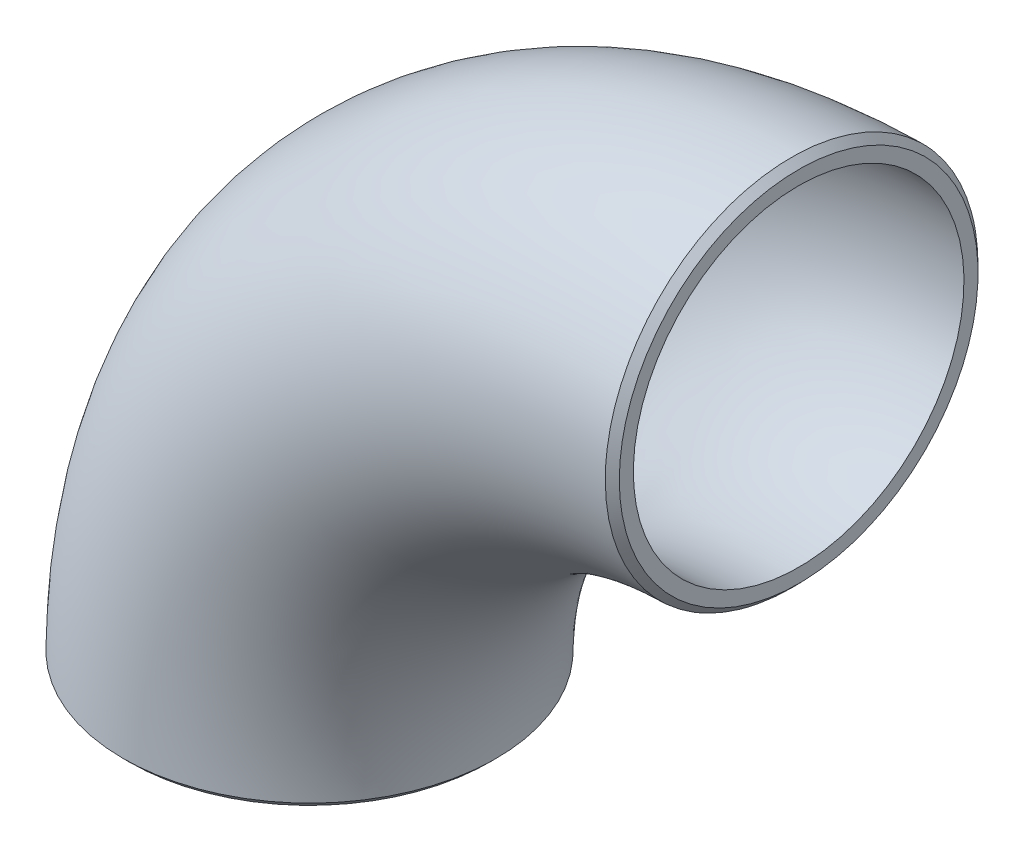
ISO-10303-21;
HEADER;
FILE_DESCRIPTION(('STEP AP214'),'2;1');
FILE_NAME('part.step','',(''),(''),'','','');
FILE_SCHEMA(('AUTOMOTIVE_DESIGN { 1 0 10303 214 1 1 1 1 }'));
ENDSEC;
DATA;
#1=APPLICATION_CONTEXT('core data for automotive mechanical design processes');
#2=APPLICATION_PROTOCOL_DEFINITION('international standard','automotive_design',2000,#1);
#3=PRODUCT_CONTEXT('',#1,'mechanical');
#4=PRODUCT('Part','Part','',(#3));
#5=PRODUCT_RELATED_PRODUCT_CATEGORY('part','',(#4));
#6=PRODUCT_DEFINITION_FORMATION('','',#4);
#7=PRODUCT_DEFINITION_CONTEXT('part definition',#1,'design');
#8=PRODUCT_DEFINITION('design','',#6,#7);
#9=PRODUCT_DEFINITION_SHAPE('','',#8);
#10=(LENGTH_UNIT() NAMED_UNIT(*) SI_UNIT(.MILLI.,.METRE.));
#11=(NAMED_UNIT(*) PLANE_ANGLE_UNIT() SI_UNIT($,.RADIAN.));
#12=(NAMED_UNIT(*) SI_UNIT($,.STERADIAN.) SOLID_ANGLE_UNIT());
#13=UNCERTAINTY_MEASURE_WITH_UNIT(LENGTH_MEASURE(1.E-05),#10,'distance_accuracy_value','');
#14=(GEOMETRIC_REPRESENTATION_CONTEXT(3) GLOBAL_UNCERTAINTY_ASSIGNED_CONTEXT((#13)) GLOBAL_UNIT_ASSIGNED_CONTEXT((#10,
#11,#12)) REPRESENTATION_CONTEXT('',''));
#15=CARTESIAN_POINT('',(0.,0.,0.));
#16=DIRECTION('',(0.,0.,1.));
#17=DIRECTION('',(1.,0.,0.));
#18=AXIS2_PLACEMENT_3D('',#15,#16,#17);
#19=CARTESIAN_POINT('',(0.,0.,0.));
#20=DIRECTION('',(0.,0.,1.));
#21=DIRECTION('',(1.,0.,0.));
#22=AXIS2_PLACEMENT_3D('',#19,#20,#21);
#23=TOROIDAL_SURFACE('',#22,133.35,50.8);
#24=CARTESIAN_POINT('',(-1.91347437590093,133.350537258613,50.7999979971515));
#25=CARTESIAN_POINT('',(-1.91168670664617,130.040766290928,50.8024889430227));
#26=CARTESIAN_POINT('',(-1.90972997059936,126.665261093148,50.4706384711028));
#27=CARTESIAN_POINT('',(-1.90565136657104,120.162251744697,49.1728025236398));
#28=CARTESIAN_POINT('',(-1.90351342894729,116.998036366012,48.2165515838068));
#29=CARTESIAN_POINT('',(-1.89900422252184,110.827994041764,45.6655046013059));
#30=CARTESIAN_POINT('',(-1.89665504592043,107.860127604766,44.0768987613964));
#31=CARTESIAN_POINT('',(-1.89197178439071,102.365414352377,40.4041645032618));
#32=CARTESIAN_POINT('',(-1.8896012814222,99.7905998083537,38.2997019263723));
#33=CARTESIAN_POINT('',(-1.88492659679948,95.0433503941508,33.5549026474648));
#34=CARTESIAN_POINT('',(-1.88269475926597,92.9418186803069,30.9863367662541));
#35=CARTESIAN_POINT('',(-1.87858529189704,89.2651823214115,25.4942020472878));
#36=CARTESIAN_POINT('',(-1.87668341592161,87.6711642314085,22.5191210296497));
#37=CARTESIAN_POINT('',(-1.87353228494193,85.1217763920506,16.3610154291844));
#38=CARTESIAN_POINT('',(-1.8722851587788,84.1627070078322,13.1981484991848));
#39=CARTESIAN_POINT('',(-1.87056904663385,82.8601240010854,6.68600468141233));
#40=CARTESIAN_POINT('',(-1.87011680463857,82.5277049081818,3.31361562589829));
#41=CARTESIAN_POINT('',(-1.87011976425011,82.5299241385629,-3.30058019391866));
#42=CARTESIAN_POINT('',(-1.87055224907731,82.8476271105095,-6.5950050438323));
#43=CARTESIAN_POINT('',(-1.87227045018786,84.151289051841,-13.1689649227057));
#44=CARTESIAN_POINT('',(-1.87353611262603,85.1248176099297,-16.3667031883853));
#45=CARTESIAN_POINT('',(-1.8766594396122,87.6518183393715,-22.4740545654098));
#46=CARTESIAN_POINT('',(-1.87853879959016,89.2247386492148,-25.4280264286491));
#47=CARTESIAN_POINT('',(-1.88270033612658,92.9456690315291,-30.997767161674));
#48=CARTESIAN_POINT('',(-1.88492871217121,95.0477205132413,-33.5527863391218));
#49=CARTESIAN_POINT('',(-1.88953471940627,99.7208003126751,-38.2363631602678));
#50=CARTESIAN_POINT('',(-1.89195087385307,102.340112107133,-40.3888554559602));
#51=CARTESIAN_POINT('',(-1.89665363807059,107.859242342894,-44.0747090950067));
#52=CARTESIAN_POINT('',(-1.89896049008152,110.772373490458,-45.63622543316));
#53=CARTESIAN_POINT('',(-1.90346791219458,116.931619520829,-48.1952531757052));
#54=CARTESIAN_POINT('',(-1.90564958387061,120.158226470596,-49.1736533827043));
#55=CARTESIAN_POINT('',(-1.90971340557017,126.64002690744,-50.4639570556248));
#56=CARTESIAN_POINT('',(-1.91163699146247,129.952936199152,-50.7951170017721));
#57=CARTESIAN_POINT('',(-1.91706816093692,139.995913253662,-50.8097284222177));
#58=CARTESIAN_POINT('',(-1.92015299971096,146.692931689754,-49.4553364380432));
#59=CARTESIAN_POINT('',(-1.92395643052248,155.847749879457,-45.6608108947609));
#60=CARTESIAN_POINT('',(-1.92511414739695,158.811110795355,-44.0794832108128));
#61=CARTESIAN_POINT('',(-1.92718623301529,164.368371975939,-40.3600459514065));
#62=CARTESIAN_POINT('',(-1.92808734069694,166.920880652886,-38.2583282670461));
#63=CARTESIAN_POINT('',(-1.92968456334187,171.606414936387,-33.5764929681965));
#64=CARTESIAN_POINT('',(-1.93038530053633,173.757789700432,-30.9534221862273));
#65=CARTESIAN_POINT('',(-1.93155163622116,177.433323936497,-25.4400451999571));
#66=CARTESIAN_POINT('',(-1.93202991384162,178.994247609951,-22.5256979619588));
#67=CARTESIAN_POINT('',(-1.93280150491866,181.552788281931,-16.3511022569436));
#68=CARTESIAN_POINT('',(-1.93308703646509,182.524454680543,-13.134120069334));
#69=CARTESIAN_POINT('',(-1.93346294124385,183.810109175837,-6.65090632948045));
#70=CARTESIAN_POINT('',(-1.93355823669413,184.141049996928,-3.33738813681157));
#71=CARTESIAN_POINT('',(-1.93355753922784,184.138640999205,3.37307013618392));
#72=CARTESIAN_POINT('',(-1.93346196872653,183.806785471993,6.67176737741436));
#73=CARTESIAN_POINT('',(-1.93308557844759,182.519465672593,13.1550810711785));
#74=CARTESIAN_POINT('',(-1.93279749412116,181.539299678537,16.3897296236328));
#75=CARTESIAN_POINT('',(-1.93202746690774,178.986323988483,22.5387272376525));
#76=CARTESIAN_POINT('',(-1.93154978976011,177.427185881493,25.4527161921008));
#77=CARTESIAN_POINT('',(-1.93037846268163,173.736567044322,30.9817306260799));
#78=CARTESIAN_POINT('',(-1.92967816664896,171.587195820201,33.5977090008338));
#79=CARTESIAN_POINT('',(-1.92808278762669,166.90797554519,38.2692266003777));
#80=CARTESIAN_POINT('',(-1.92718034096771,164.351559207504,40.3741857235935));
#81=CARTESIAN_POINT('',(-1.92510060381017,158.775811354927,44.1001885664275));
#82=CARTESIAN_POINT('',(-1.92394959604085,155.830045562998,45.6687454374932));
#83=CARTESIAN_POINT('',(-1.92141164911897,149.723754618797,48.1985088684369));
#84=CARTESIAN_POINT('',(-1.92000488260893,146.517093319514,49.1748632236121));
#85=CARTESIAN_POINT('',(-1.91691415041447,139.952223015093,50.4781224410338));
#86=CARTESIAN_POINT('',(-1.9152620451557,136.660308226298,50.7975070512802));
#87=CARTESIAN_POINT('',(-1.91347437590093,133.350537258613,50.7999979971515));
#88=B_SPLINE_CURVE_WITH_KNOTS('',3,(#24,#25,#26,#27,#28,#29,#30,#31,#32,#33,#34,#35,#36,#37,#38,
#39,#40,#41,#42,#43,#44,#45,#46,#47,#48,#49,#50,#51,#52,#53,#54,#55,#56,#57,#58,#59,#60,#61,#62,
#63,#64,#65,#66,#67,#68,#69,#70,#71,#72,#73,#74,#75,#76,#77,#78,#79,#80,#81,#82,#83,#84,#85,#86,
#87),.UNSPECIFIED.,.T.,.F.,(4,2,2,2,2,2,2,2,2,2,2,2,2,2,2,2,2,2,2,2,2,2,2,2,2,2,2,2,2,2,2,4),
(-0.300527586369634,-0.290975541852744,-0.281423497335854,-0.271871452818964,-0.262319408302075,
-0.252767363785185,-0.243215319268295,-0.233663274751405,-0.224111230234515,-0.214559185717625,
-0.205007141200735,-0.195455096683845,-0.185903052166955,-0.176351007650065,-0.166798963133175,
-0.157246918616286,-0.147694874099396,-0.128590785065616,-0.119038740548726,-0.109486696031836,
-0.0999346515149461,-0.0903826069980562,-0.0808305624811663,-0.0712785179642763,
-0.0617264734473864,-0.0521744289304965,-0.0426223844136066,-0.0330703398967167,
-0.0235182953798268,-0.0139662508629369,-0.00441420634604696,0.00513783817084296),.UNSPECIFIED.);
#89=CARTESIAN_POINT('',(-1.91347437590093,133.350537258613,50.7999979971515));
#90=VERTEX_POINT('',#89);
#91=EDGE_CURVE('E42',#90,#90,#88,.F.);
#92=ORIENTED_EDGE('',*,*,#91,.T.);
#93=EDGE_LOOP('',(#92));
#94=FACE_BOUND('',#93,.T.);
#95=CARTESIAN_POINT('',(-133.350537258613,1.9134743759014,50.7999979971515));
#96=CARTESIAN_POINT('',(-134.208436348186,1.91393800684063,50.8000303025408));
#97=CARTESIAN_POINT('',(-135.066284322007,1.91439282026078,50.7778714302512));
#98=CARTESIAN_POINT('',(-136.784164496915,1.91528731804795,50.6898317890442));
#99=CARTESIAN_POINT('',(-137.644185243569,1.91572691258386,50.6237267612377));
#100=CARTESIAN_POINT('',(-139.359886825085,1.91658874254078,50.4484662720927));
#101=CARTESIAN_POINT('',(-140.215567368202,1.91701097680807,50.3393079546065));
#102=CARTESIAN_POINT('',(-141.915993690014,1.91783552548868,50.0777767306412));
#103=CARTESIAN_POINT('',(-142.760772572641,1.91823792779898,49.9256193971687));
#104=CARTESIAN_POINT('',(-144.437558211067,1.91902338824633,49.5795395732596));
#105=CARTESIAN_POINT('',(-145.269606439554,1.91940652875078,49.3858176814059));
#106=CARTESIAN_POINT('',(-146.92247059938,1.9201555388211,48.9570451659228));
#107=CARTESIAN_POINT('',(-147.743292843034,1.92052141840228,48.7220188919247));
#108=CARTESIAN_POINT('',(-149.373928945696,1.92123693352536,48.2100528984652));
#109=CARTESIAN_POINT('',(-150.183711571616,1.92158652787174,47.9330137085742));
#110=CARTESIAN_POINT('',(-151.792525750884,1.92227065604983,47.3370597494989));
#111=CARTESIAN_POINT('',(-152.591479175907,1.92260510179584,47.0179340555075));
#112=CARTESIAN_POINT('',(-154.173888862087,1.92325783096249,46.3384813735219));
#113=CARTESIAN_POINT('',(-154.957304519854,1.923576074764,45.9780597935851));
#114=CARTESIAN_POINT('',(-156.503931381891,1.92419554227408,45.21835643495));
#115=CARTESIAN_POINT('',(-157.267164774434,1.92449678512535,44.8191197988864));
#116=CARTESIAN_POINT('',(-158.77000062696,1.92508198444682,43.9840012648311));
#117=CARTESIAN_POINT('',(-159.509673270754,1.92536599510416,43.5482457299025));
#118=CARTESIAN_POINT('',(-160.962138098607,1.92591649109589,42.6416971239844));
#119=CARTESIAN_POINT('',(-161.675045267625,1.92618305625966,42.1710882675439));
#120=CARTESIAN_POINT('',(-163.076481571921,1.92670074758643,41.1946733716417));
#121=CARTESIAN_POINT('',(-163.765007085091,1.92695187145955,40.6888621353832));
#122=CARTESIAN_POINT('',(-165.117783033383,1.92743954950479,39.6415975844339));
#123=CARTESIAN_POINT('',(-165.781952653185,1.9276760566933,39.1000398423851));
#124=CARTESIAN_POINT('',(-167.08500885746,1.92813494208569,37.9813627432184));
#125=CARTESIAN_POINT('',(-167.723763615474,1.92835724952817,37.4040898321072));
#126=CARTESIAN_POINT('',(-168.973849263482,1.92878779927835,36.2152681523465));
#127=CARTESIAN_POINT('',(-169.585048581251,1.92899597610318,35.6035810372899));
#128=CARTESIAN_POINT('',(-170.772352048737,1.92939646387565,34.3531484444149));
#129=CARTESIAN_POINT('',(-171.348623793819,1.92958885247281,33.7145621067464));
#130=CARTESIAN_POINT('',(-172.465127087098,1.92995814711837,32.4120622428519));
#131=CARTESIAN_POINT('',(-173.005521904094,1.93013512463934,31.7482886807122));
#132=CARTESIAN_POINT('',(-174.050704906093,1.93047449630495,30.3961283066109));
#133=CARTESIAN_POINT('',(-174.555584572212,1.93063692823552,29.7078121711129));
#134=CARTESIAN_POINT('',(-175.530786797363,1.93094831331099,28.3061916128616));
#135=CARTESIAN_POINT('',(-176.001077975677,1.93109725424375,27.5928653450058));
#136=CARTESIAN_POINT('',(-176.907234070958,1.93138218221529,26.138815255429));
#137=CARTESIAN_POINT('',(-177.342879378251,1.93151808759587,25.3979545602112));
#138=CARTESIAN_POINT('',(-178.177692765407,1.93177681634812,23.8929271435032));
#139=CARTESIAN_POINT('',(-178.576741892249,1.93189959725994,23.1286944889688));
#140=CARTESIAN_POINT('',(-179.335507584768,1.93213167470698,21.5811293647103));
#141=CARTESIAN_POINT('',(-179.69523242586,1.93224097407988,20.7978009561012));
#142=CARTESIAN_POINT('',(-180.372700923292,1.93244579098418,19.2166241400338));
#143=CARTESIAN_POINT('',(-180.690594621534,1.93254135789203,18.4188399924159));
#144=CARTESIAN_POINT('',(-181.284598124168,1.93271915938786,16.8117500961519));
#145=CARTESIAN_POINT('',(-181.560881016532,1.93280144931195,16.0025083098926));
#146=CARTESIAN_POINT('',(-182.071663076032,1.93295297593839,14.3721674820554));
#147=CARTESIAN_POINT('',(-182.306219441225,1.93302223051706,13.5510863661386));
#148=CARTESIAN_POINT('',(-182.73419833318,1.93314818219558,11.8968656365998));
#149=CARTESIAN_POINT('',(-182.92755384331,1.93320485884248,11.0637086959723));
#150=CARTESIAN_POINT('',(-183.272794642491,1.93330586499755,9.3846254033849));
#151=CARTESIAN_POINT('',(-183.424474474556,1.9333501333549,8.53865674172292));
#152=CARTESIAN_POINT('',(-183.684822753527,1.93342598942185,6.83683841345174));
#153=CARTESIAN_POINT('',(-183.793325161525,1.93345752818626,5.98096338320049));
#154=CARTESIAN_POINT('',(-183.967184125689,1.93350798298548,4.26554139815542));
#155=CARTESIAN_POINT('',(-184.032575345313,1.93352690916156,3.40599795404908));
#156=CARTESIAN_POINT('',(-184.119037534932,1.93355189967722,1.68936979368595));
#157=CARTESIAN_POINT('',(-184.140348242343,1.93355803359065,0.832297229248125));
#158=CARTESIAN_POINT('',(-184.139339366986,1.9335577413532,-0.877720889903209));
#159=CARTESIAN_POINT('',(-184.117227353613,1.93355137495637,-1.73066663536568));
#160=CARTESIAN_POINT('',(-184.030482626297,1.9335263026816,-3.43509659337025));
#161=CARTESIAN_POINT('',(-183.965815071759,1.93350758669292,-4.28657903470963));
#162=CARTESIAN_POINT('',(-183.793078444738,1.93345745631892,-5.98824040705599));
#163=CARTESIAN_POINT('',(-183.68485364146,1.9334259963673,-6.83840355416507));
#164=CARTESIAN_POINT('',(-183.424732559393,1.93335020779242,-8.53754079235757));
#165=CARTESIAN_POINT('',(-183.272563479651,1.93330579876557,-9.38647309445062));
#166=CARTESIAN_POINT('',(-182.925112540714,1.93320414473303,-11.0760513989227));
#167=CARTESIAN_POINT('',(-182.729802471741,1.93314689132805,-11.9166916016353));
#168=CARTESIAN_POINT('',(-182.29739781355,1.93301962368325,-13.5837945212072));
#169=CARTESIAN_POINT('',(-182.060462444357,1.93294965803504,-14.4102985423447));
#170=CARTESIAN_POINT('',(-181.545936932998,1.93279700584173,-16.0473337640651));
#171=CARTESIAN_POINT('',(-181.268493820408,1.93271436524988,-16.8579111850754));
#172=CARTESIAN_POINT('',(-180.673973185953,1.93253637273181,-18.4614836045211));
#173=CARTESIAN_POINT('',(-180.357023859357,1.93244106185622,-19.254526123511));
#174=CARTESIAN_POINT('',(-179.682762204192,1.93223718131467,-20.8251055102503));
#175=CARTESIAN_POINT('',(-179.325371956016,1.93212858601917,-21.6026089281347));
#176=CARTESIAN_POINT('',(-178.570458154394,1.93189768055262,-23.1414239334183));
#177=CARTESIAN_POINT('',(-178.172791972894,1.93177532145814,-23.90266553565));
#178=CARTESIAN_POINT('',(-177.338121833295,1.93151661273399,-25.4065154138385));
#179=CARTESIAN_POINT('',(-176.900994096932,1.93138021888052,-26.1490550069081));
#180=CARTESIAN_POINT('',(-175.988460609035,1.93109326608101,-27.6124172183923));
#181=CARTESIAN_POINT('',(-175.512975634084,1.93094267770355,-28.3331904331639));
#182=CARTESIAN_POINT('',(-174.528610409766,1.93062828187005,-29.7459264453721));
#183=CARTESIAN_POINT('',(-174.019919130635,1.93046454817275,-30.4380209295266));
#184=CARTESIAN_POINT('',(-172.970454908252,1.93012360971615,-31.7922266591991));
#185=CARTESIAN_POINT('',(-172.429844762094,1.9299464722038,-32.4544640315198));
#186=CARTESIAN_POINT('',(-171.316865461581,1.92957818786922,-33.749562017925));
#187=CARTESIAN_POINT('',(-170.744556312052,1.92938706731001,-34.3824742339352));
#188=CARTESIAN_POINT('',(-169.568127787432,1.92899019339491,-35.6202247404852));
#189=CARTESIAN_POINT('',(-168.963952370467,1.92878441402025,-36.2250097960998));
#190=CARTESIAN_POINT('',(-167.721163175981,1.92835636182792,-37.4066491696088));
#191=CARTESIAN_POINT('',(-167.082346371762,1.92813398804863,-37.9832900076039));
#192=CARTESIAN_POINT('',(-165.774685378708,1.92767344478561,-39.105348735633));
#193=CARTESIAN_POINT('',(-165.105760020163,1.92743523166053,-39.6506719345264));
#194=CARTESIAN_POINT('',(-163.742590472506,1.92694376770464,-40.7057658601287));
#195=CARTESIAN_POINT('',(-163.04840075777,1.92669054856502,-41.2156068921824));
#196=CARTESIAN_POINT('',(-161.638643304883,1.92616953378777,-42.1958833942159));
#197=CARTESIAN_POINT('',(-160.923220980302,1.925901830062,-42.6665280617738));
#198=CARTESIAN_POINT('',(-159.47181198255,1.92535145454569,-43.570293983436));
#199=CARTESIAN_POINT('',(-158.735887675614,1.92506882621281,-44.003515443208));
#200=CARTESIAN_POINT('',(-157.242724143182,1.92448722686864,-44.8323425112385));
#201=CARTESIAN_POINT('',(-156.485475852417,1.9241882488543,-45.2279317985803));
#202=CARTESIAN_POINT('',(-154.949358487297,1.92357283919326,-45.9816947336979));
#203=CARTESIAN_POINT('',(-154.170424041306,1.92325635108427,-46.3397350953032));
#204=CARTESIAN_POINT('',(-152.591691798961,1.92260516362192,-47.0177168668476));
#205=CARTESIAN_POINT('',(-151.791811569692,1.92227038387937,-47.3374664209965));
#206=CARTESIAN_POINT('',(-150.175940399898,1.92158322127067,-47.9358760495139));
#207=CARTESIAN_POINT('',(-149.359934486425,1.92123082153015,-48.2144956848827));
#208=CARTESIAN_POINT('',(-147.716450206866,1.92050950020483,-48.729735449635));
#209=CARTESIAN_POINT('',(-146.888996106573,1.92014061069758,-48.9664330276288));
#210=CARTESIAN_POINT('',(-145.226989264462,1.91938715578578,-49.3965077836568));
#211=CARTESIAN_POINT('',(-144.392487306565,1.91900267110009,-49.5900809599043));
#212=CARTESIAN_POINT('',(-142.717580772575,1.91821742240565,-49.9336700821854));
#213=CARTESIAN_POINT('',(-141.87720663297,1.91781671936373,-50.0838345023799));
#214=CARTESIAN_POINT('',(-140.188072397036,1.91699710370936,-50.3421685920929));
#215=CARTESIAN_POINT('',(-139.339297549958,1.91657815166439,-50.4502417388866));
#216=CARTESIAN_POINT('',(-137.634556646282,1.91572149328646,-50.6237730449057));
#217=CARTESIAN_POINT('',(-136.778576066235,1.91528372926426,-50.6890884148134));
#218=CARTESIAN_POINT('',(-135.060724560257,1.91438934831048,-50.7770980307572));
#219=CARTESIAN_POINT('',(-134.198844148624,1.91393265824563,-50.7996073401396));
#220=CARTESIAN_POINT('',(-132.472990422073,1.91300029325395,-50.8003935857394));
#221=CARTESIAN_POINT('',(-131.609017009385,1.91252457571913,-50.7785650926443));
#222=CARTESIAN_POINT('',(-129.883700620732,1.91155535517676,-50.6900370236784));
#223=CARTESIAN_POINT('',(-129.022356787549,1.91106185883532,-50.6233541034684));
#224=CARTESIAN_POINT('',(-127.304827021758,1.91005856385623,-50.4462450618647));
#225=CARTESIAN_POINT('',(-126.448637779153,1.90954877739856,-50.3358509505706));
#226=CARTESIAN_POINT('',(-124.74395554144,1.90851401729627,-50.0720267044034));
#227=CARTESIAN_POINT('',(-123.895454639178,1.90798906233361,-49.9186476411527));
#228=CARTESIAN_POINT('',(-122.208686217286,1.90692518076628,-49.569671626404));
#229=CARTESIAN_POINT('',(-121.370403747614,1.90638627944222,-49.3741469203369));
#230=CARTESIAN_POINT('',(-119.706617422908,1.90529568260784,-48.9416537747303));
#231=CARTESIAN_POINT('',(-118.881088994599,1.90474401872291,-48.7047798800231));
#232=CARTESIAN_POINT('',(-117.245340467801,1.90362912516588,-48.1904140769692));
#233=CARTESIAN_POINT('',(-116.435083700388,1.9030659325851,-47.9130388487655));
#234=CARTESIAN_POINT('',(-114.832227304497,1.90192886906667,-47.3182348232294));
#235=CARTESIAN_POINT('',(-114.039581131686,1.90135503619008,-47.0009315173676));
#236=CARTESIAN_POINT('',(-112.46914015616,1.90019460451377,-46.3253594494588));
#237=CARTESIAN_POINT('',(-111.691396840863,1.89960797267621,-45.9669710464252));
#238=CARTESIAN_POINT('',(-110.151706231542,1.89842352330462,-45.2099223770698));
#239=CARTESIAN_POINT('',(-109.38983918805,1.89782566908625,-44.8110989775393));
#240=CARTESIAN_POINT('',(-107.885298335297,1.89662178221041,-43.9744547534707));
#241=CARTESIAN_POINT('',(-107.142677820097,1.89601573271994,-43.5365380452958));
#242=CARTESIAN_POINT('',(-105.680545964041,1.8947987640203,-42.6230848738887));
#243=CARTESIAN_POINT('',(-104.961043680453,1.8941878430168,-42.147533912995));
#244=CARTESIAN_POINT('',(-103.550787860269,1.89296705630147,-41.1631715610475));
#245=CARTESIAN_POINT('',(-102.859903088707,1.89235720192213,-40.6545481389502));
#246=CARTESIAN_POINT('',(-101.507588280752,1.89114097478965,-39.6049875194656));
#247=CARTESIAN_POINT('',(-100.846050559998,1.89053459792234,-39.064189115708));
#248=CARTESIAN_POINT('',(-99.5518423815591,1.88932660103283,-37.9504495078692));
#249=CARTESIAN_POINT('',(-98.9191422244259,1.88872497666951,-37.3775427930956));
#250=CARTESIAN_POINT('',(-97.6814219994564,1.88752716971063,-36.1994876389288));
#251=CARTESIAN_POINT('',(-97.0764762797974,1.88693100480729,-35.5942610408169));
#252=CARTESIAN_POINT('',(-95.8947601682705,1.88574591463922,-34.3495035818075));
#253=CARTESIAN_POINT('',(-95.3181948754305,1.8851570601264,-33.7097779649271));
#254=CARTESIAN_POINT('',(-94.1966801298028,1.88399298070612,-32.4006956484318));
#255=CARTESIAN_POINT('',(-93.6518054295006,1.88341778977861,-31.7312749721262));
#256=CARTESIAN_POINT('',(-92.5980530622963,1.88228803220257,-30.3676847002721));
#257=CARTESIAN_POINT('',(-92.0890775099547,1.8817334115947,-29.6735908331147));
#258=CARTESIAN_POINT('',(-91.1108379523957,1.88065105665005,-28.2644831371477));
#259=CARTESIAN_POINT('',(-90.6413427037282,1.88012317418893,-27.5496297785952));
#260=CARTESIAN_POINT('',(-89.7393831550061,1.87909530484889,-26.0988984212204));
#261=CARTESIAN_POINT('',(-89.3068475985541,1.8785952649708,-25.3630647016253));
#262=CARTESIAN_POINT('',(-88.4789848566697,1.87762599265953,-23.8694331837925));
#263=CARTESIAN_POINT('',(-88.0837090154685,1.87715680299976,-23.1116069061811));
#264=CARTESIAN_POINT('',(-87.330325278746,1.87625203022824,-21.5735990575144));
#265=CARTESIAN_POINT('',(-86.9723873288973,1.87581660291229,-20.7933342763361));
#266=CARTESIAN_POINT('',(-86.2947561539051,1.87498360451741,-19.2119389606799));
#267=CARTESIAN_POINT('',(-85.9752543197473,1.87458622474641,-18.4107263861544));
#268=CARTESIAN_POINT('',(-85.3779073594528,1.87383654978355,-16.793663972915));
#269=CARTESIAN_POINT('',(-85.1000285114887,1.87348421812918,-15.9778265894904));
#270=CARTESIAN_POINT('',(-84.5865537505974,1.87282782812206,-14.3352837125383));
#271=CARTESIAN_POINT('',(-84.3508498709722,1.87252364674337,-13.5086119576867));
#272=CARTESIAN_POINT('',(-83.9226125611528,1.87196718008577,-11.847856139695));
#273=CARTESIAN_POINT('',(-83.7299019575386,1.8717146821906,-11.0138177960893));
#274=CARTESIAN_POINT('',(-83.3875526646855,1.87126414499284,-9.33919018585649));
#275=CARTESIAN_POINT('',(-83.2378043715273,1.87106596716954,-8.4986233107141));
#276=CARTESIAN_POINT('',(-82.9802663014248,1.87072398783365,-6.80886407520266));
#277=CARTESIAN_POINT('',(-82.8725860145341,1.87058032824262,-5.95965503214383));
#278=CARTESIAN_POINT('',(-82.6999933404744,1.87034930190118,-4.2536389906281));
#279=CARTESIAN_POINT('',(-82.6352448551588,1.87026215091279,-3.39681538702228));
#280=CARTESIAN_POINT('',(-82.5491433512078,1.87014595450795,-1.67668978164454));
#281=CARTESIAN_POINT('',(-82.5280093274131,1.87011720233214,-0.813376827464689));
#282=CARTESIAN_POINT('',(-82.5296670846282,1.87011943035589,0.912317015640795));
#283=CARTESIAN_POINT('',(-82.5524136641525,1.87015034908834,1.77469794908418));
#284=CARTESIAN_POINT('',(-82.6415901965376,1.87027065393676,3.4918553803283));
#285=CARTESIAN_POINT('',(-82.7077490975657,1.87035967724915,4.3466459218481));
#286=CARTESIAN_POINT('',(-82.8831323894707,1.87059437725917,6.04860784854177));
#287=CARTESIAN_POINT('',(-82.9921973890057,1.87073984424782,6.89579569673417));
#288=CARTESIAN_POINT('',(-83.2522438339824,1.87108508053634,8.5827064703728));
#289=CARTESIAN_POINT('',(-83.403176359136,1.87128478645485,9.42243693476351));
#290=CARTESIAN_POINT('',(-83.748405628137,1.8717389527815,11.0972246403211));
#291=CARTESIAN_POINT('',(-83.9429105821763,1.8719936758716,11.9322390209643));
#292=CARTESIAN_POINT('',(-84.3750313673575,1.87255487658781,13.5954200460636));
#293=CARTESIAN_POINT('',(-84.6128551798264,1.87286160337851,14.423532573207));
#294=CARTESIAN_POINT('',(-85.1300964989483,1.87352240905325,16.0676392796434));
#295=CARTESIAN_POINT('',(-85.409557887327,1.87387653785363,16.8836196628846));
#296=CARTESIAN_POINT('',(-86.009255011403,1.87462862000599,18.497912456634));
#297=CARTESIAN_POINT('',(-86.3293767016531,1.87502645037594,19.2962672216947));
#298=CARTESIAN_POINT('',(-87.0079783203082,1.87586000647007,20.8720376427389));
#299=CARTESIAN_POINT('',(-87.3662705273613,1.87629554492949,21.6495341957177));
#300=CARTESIAN_POINT('',(-88.1207681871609,1.87720099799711,23.1836423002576));
#301=CARTESIAN_POINT('',(-88.516882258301,1.87767082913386,23.9402987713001));
#302=CARTESIAN_POINT('',(-89.3471778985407,1.87864216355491,25.4330605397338));
#303=CARTESIAN_POINT('',(-89.7813839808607,1.87914368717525,26.1691521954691));
#304=CARTESIAN_POINT('',(-90.6876426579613,1.8801754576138,27.6214248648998));
#305=CARTESIAN_POINT('',(-91.1598283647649,1.88070580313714,28.3375228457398));
#306=CARTESIAN_POINT('',(-92.1426695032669,1.88179207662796,29.7478237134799));
#307=CARTESIAN_POINT('',(-92.6534951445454,1.88234811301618,30.4419080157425));
#308=CARTESIAN_POINT('',(-93.7100408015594,1.88347957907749,31.8040625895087));
#309=CARTESIAN_POINT('',(-94.2557947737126,1.88405502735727,32.4721064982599));
#310=CARTESIAN_POINT('',(-95.3784415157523,1.88521888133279,33.777672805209));
#311=CARTESIAN_POINT('',(-95.9552250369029,1.88580723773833,34.4152890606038));
#312=CARTESIAN_POINT('',(-97.1371264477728,1.88699108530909,35.6558801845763));
#313=CARTESIAN_POINT('',(-97.7420381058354,1.88758650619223,36.2590515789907));
#314=CARTESIAN_POINT('',(-98.9804670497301,1.88878360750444,37.4339365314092));
#315=CARTESIAN_POINT('',(-99.6139539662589,1.88938528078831,38.0056821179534));
#316=CARTESIAN_POINT('',(-100.910587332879,1.8905941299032,39.117879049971));
#317=CARTESIAN_POINT('',(-101.573803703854,1.89120131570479,39.6582489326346));
#318=CARTESIAN_POINT('',(-102.93028210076,1.89241975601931,40.7073934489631));
#319=CARTESIAN_POINT('',(-103.623682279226,1.89303101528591,41.2159894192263));
#320=CARTESIAN_POINT('',(-105.038916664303,1.89425437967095,42.1999351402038));
#321=CARTESIAN_POINT('',(-105.760877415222,1.89486647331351,42.6751028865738));
#322=CARTESIAN_POINT('',(-107.225406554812,1.89608361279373,43.5862619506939));
#323=CARTESIAN_POINT('',(-107.967888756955,1.896688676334,44.0223917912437));
#324=CARTESIAN_POINT('',(-109.471082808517,1.89788967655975,44.8547181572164));
#325=CARTESIAN_POINT('',(-110.231711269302,1.89848563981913,45.2510653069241));
#326=CARTESIAN_POINT('',(-111.769492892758,1.89966688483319,46.003605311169));
#327=CARTESIAN_POINT('',(-112.546583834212,1.90025219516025,46.3599253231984));
#328=CARTESIAN_POINT('',(-114.117238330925,1.90141167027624,47.0327222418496));
#329=CARTESIAN_POINT('',(-114.910790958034,1.90198584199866,47.3492246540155));
#330=CARTESIAN_POINT('',(-116.516168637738,1.90312446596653,47.9428646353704));
#331=CARTESIAN_POINT('',(-117.328055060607,1.90368886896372,48.2198362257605));
#332=CARTESIAN_POINT('',(-118.96749208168,1.90480636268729,48.7333667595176));
#333=CARTESIAN_POINT('',(-119.795086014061,1.90535940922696,48.9697873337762));
#334=CARTESIAN_POINT('',(-121.463236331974,1.90645234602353,49.4008124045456));
#335=CARTESIAN_POINT('',(-122.303819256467,1.90699220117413,49.5953142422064));
#336=CARTESIAN_POINT('',(-123.992272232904,1.90805527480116,49.9408889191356));
#337=CARTESIAN_POINT('',(-124.840126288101,1.90857852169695,50.0920399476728));
#338=CARTESIAN_POINT('',(-126.537469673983,1.909605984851,50.3503829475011));
#339=CARTESIAN_POINT('',(-127.386920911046,1.9101102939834,50.4578251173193));
#340=CARTESIAN_POINT('',(-129.087679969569,1.91110094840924,50.6291901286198));
#341=CARTESIAN_POINT('',(-129.938975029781,1.91158734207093,50.693239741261));
#342=CARTESIAN_POINT('',(-131.64369973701,1.91254344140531,50.7786017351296));
#343=CARTESIAN_POINT('',(-132.497129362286,1.91301314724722,50.7999145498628));
#344=CARTESIAN_POINT('',(-133.350537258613,1.9134743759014,50.7999979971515));
#345=B_SPLINE_CURVE_WITH_KNOTS('',3,(#95,#96,#97,#98,#99,#100,#101,#102,#103,#104,#105,#106,
#107,#108,#109,#110,#111,#112,#113,#114,#115,#116,#117,#118,#119,#120,#121,#122,#123,#124,#125,
#126,#127,#128,#129,#130,#131,#132,#133,#134,#135,#136,#137,#138,#139,#140,#141,#142,#143,#144,
#145,#146,#147,#148,#149,#150,#151,#152,#153,#154,#155,#156,#157,#158,#159,#160,#161,#162,#163,
#164,#165,#166,#167,#168,#169,#170,#171,#172,#173,#174,#175,#176,#177,#178,#179,#180,#181,#182,
#183,#184,#185,#186,#187,#188,#189,#190,#191,#192,#193,#194,#195,#196,#197,#198,#199,#200,#201,
#202,#203,#204,#205,#206,#207,#208,#209,#210,#211,#212,#213,#214,#215,#216,#217,#218,#219,#220,
#221,#222,#223,#224,#225,#226,#227,#228,#229,#230,#231,#232,#233,#234,#235,#236,#237,#238,#239,
#240,#241,#242,#243,#244,#245,#246,#247,#248,#249,#250,#251,#252,#253,#254,#255,#256,#257,#258,
#259,#260,#261,#262,#263,#264,#265,#266,#267,#268,#269,#270,#271,#272,#273,#274,#275,#276,#277,
#278,#279,#280,#281,#282,#283,#284,#285,#286,#287,#288,#289,#290,#291,#292,#293,#294,#295,#296,
#297,#298,#299,#300,#301,#302,#303,#304,#305,#306,#307,#308,#309,#310,#311,#312,#313,#314,#315,
#316,#317,#318,#319,#320,#321,#322,#323,#324,#325,#326,#327,#328,#329,#330,#331,#332,#333,#334,
#335,#336,#337,#338,#339,#340,#341,#342,#343,#344),.UNSPECIFIED.,.F.,.F.,(4,2,2,2,2,2,2,2,2,2,2,
2,2,2,2,2,2,2,2,2,2,2,2,2,2,2,2,2,2,2,2,2,2,2,2,2,2,2,2,2,2,2,2,2,2,2,2,2,2,2,2,2,2,2,2,2,2,2,2,
2,2,2,2,2,2,2,2,2,2,2,2,2,2,2,2,2,2,2,2,2,2,2,2,2,2,2,2,2,2,2,2,2,2,2,2,2,2,2,2,2,2,2,2,2,2,2,2,
2,2,2,2,2,2,2,2,2,2,2,2,2,2,2,2,2,4),(0.,2.57333194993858,5.15989755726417,7.7466347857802,
10.3206268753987,12.8824651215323,15.4427981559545,18.0092905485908,20.5891723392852,
23.1750863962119,25.7580281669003,28.3323748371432,30.8939718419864,33.4559478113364,
36.0257712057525,38.6075360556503,41.2005465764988,43.7799264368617,46.3466241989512,
48.9064481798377,51.4685666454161,54.0458095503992,56.6311528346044,59.2159510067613,
61.791209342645,64.3554405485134,66.9161291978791,69.4809517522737,72.0582005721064,
74.6452665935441,77.2302499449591,79.8011371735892,82.3597649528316,84.920490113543,
87.4904531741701,90.0767264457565,92.6646959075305,95.242973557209,97.8121154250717,
100.373127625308,102.939161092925,105.514622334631,108.098462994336,110.687784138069,
113.263474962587,115.827005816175,118.385839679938,120.94933432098,123.529947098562,
126.117991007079,128.700751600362,131.268701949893,133.829548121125,136.391499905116,
138.962258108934,141.545401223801,144.131067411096,146.711905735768,149.280763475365,
151.840727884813,154.40652865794,156.980854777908,159.566277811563,162.157855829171,
164.748472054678,167.337194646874,169.922854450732,172.50411671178,175.079552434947,
177.647709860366,180.207988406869,182.775921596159,185.354661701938,187.939910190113,
190.526159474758,193.098814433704,195.661079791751,198.220643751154,200.78670559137,
203.369190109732,205.957537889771,208.538530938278,211.103165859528,213.662739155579,
216.225789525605,218.800038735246,221.386617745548,223.971089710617,226.548847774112,
229.11577829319,231.676100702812,234.243043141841,236.819729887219,239.409323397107,
241.996250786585,244.56717802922,247.128643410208,249.687128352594,252.258110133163,
254.841777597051,257.428187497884,260.007496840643,262.57466060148,265.135771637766,
267.698543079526,270.270724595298,272.854982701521,275.441792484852,278.020025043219,
280.581665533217,283.140644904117,285.705995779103,288.284669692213,290.876442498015,
293.458620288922,296.030620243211,298.594203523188,301.15613622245,303.728527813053,
306.309529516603,308.896782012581,311.479338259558,314.046896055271,316.606920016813,
319.166918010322),.UNSPECIFIED.);
#346=CARTESIAN_POINT('',(-133.350537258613,1.9134743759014,50.7999979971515));
#347=VERTEX_POINT('',#346);
#348=EDGE_CURVE('E47',#347,#347,#345,.F.);
#349=ORIENTED_EDGE('',*,*,#348,.T.);
#350=EDGE_LOOP('',(#349));
#351=FACE_BOUND('',#350,.T.);
#352=ADVANCED_FACE('F30',(#94,#351),#23,.T.);
#353=CARTESIAN_POINT('',(4.35979388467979E-13,133.35,0.));
#354=DIRECTION('',(1.,0.,0.));
#355=DIRECTION('',(0.,0.,1.));
#356=AXIS2_PLACEMENT_3D('',#353,#354,#355);
#357=PLANE('',#356);
#358=CARTESIAN_POINT('',(5.24664499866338E-13,133.35,48.8865314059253));
#359=CARTESIAN_POINT('',(5.27330513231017E-13,134.171211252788,48.8859894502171));
#360=CARTESIAN_POINT('',(5.30012049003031E-13,134.992431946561,48.8650213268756));
#361=CARTESIAN_POINT('',(5.35388428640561E-13,136.632861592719,48.7819623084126));
#362=CARTESIAN_POINT('',(5.38083273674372E-13,137.452070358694,48.7198677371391));
#363=CARTESIAN_POINT('',(5.43476162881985E-13,139.088759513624,48.5540359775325));
#364=CARTESIAN_POINT('',(5.46174192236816E-13,139.906227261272,48.4501739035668));
#365=CARTESIAN_POINT('',(5.51554148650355E-13,141.539684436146,48.2006053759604));
#366=CARTESIAN_POINT('',(5.54235886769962E-13,142.355636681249,48.0546556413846));
#367=CARTESIAN_POINT('',(5.595830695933E-13,143.98045159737,47.721128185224));
#368=CARTESIAN_POINT('',(5.622484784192E-13,144.789299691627,47.5334794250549));
#369=CARTESIAN_POINT('',(5.67549648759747E-13,146.394345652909,47.1177672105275));
#370=CARTESIAN_POINT('',(5.70185468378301E-13,147.190570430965,46.8898076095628));
#371=CARTESIAN_POINT('',(5.75408046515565E-13,148.76781960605,46.3947386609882));
#372=CARTESIAN_POINT('',(5.77994940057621E-13,149.548886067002,46.1277633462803));
#373=CARTESIAN_POINT('',(5.83100556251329E-13,151.093363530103,45.5556203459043));
#374=CARTESIAN_POINT('',(5.85619509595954E-13,151.856832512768,45.2506091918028));
#375=CARTESIAN_POINT('',(5.90602986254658E-13,153.367997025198,44.6022503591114));
#376=CARTESIAN_POINT('',(5.9306746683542E-13,154.115680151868,44.2588737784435));
#377=CARTESIAN_POINT('',(5.9793652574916E-13,155.595261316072,43.5337063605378));
#378=CARTESIAN_POINT('',(6.00340878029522E-13,156.327098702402,43.1517917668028));
#379=CARTESIAN_POINT('',(6.05080504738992E-13,157.773326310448,42.3498482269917));
#380=CARTESIAN_POINT('',(6.07415472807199E-13,158.487637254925,41.9296762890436));
#381=CARTESIAN_POINT('',(6.119862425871E-13,159.89647095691,41.0519507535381));
#382=CARTESIAN_POINT('',(6.14221658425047E-13,160.590913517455,40.5942684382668));
#383=CARTESIAN_POINT('',(6.18654994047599E-13,161.952149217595,39.6465929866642));
#384=CARTESIAN_POINT('',(6.20853046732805E-13,162.619065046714,39.1567760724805));
#385=CARTESIAN_POINT('',(6.25176563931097E-13,163.923713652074,38.1464001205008));
#386=CARTESIAN_POINT('',(6.27302343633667E-13,164.561578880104,37.6260121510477));
#387=CARTESIAN_POINT('',(6.31457758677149E-13,165.808643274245,36.5549541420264));
#388=CARTESIAN_POINT('',(6.3348761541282E-13,166.417908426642,36.0043608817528));
#389=CARTESIAN_POINT('',(6.37417976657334E-13,167.608993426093,34.8729396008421));
#390=CARTESIAN_POINT('',(6.39318334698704E-13,168.190781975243,34.2920786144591));
#391=CARTESIAN_POINT('',(6.43048795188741E-13,169.327476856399,33.0973793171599));
#392=CARTESIAN_POINT('',(6.44878359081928E-13,169.882183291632,32.483350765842));
#393=CARTESIAN_POINT('',(6.48441495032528E-13,170.961799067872,31.2261387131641));
#394=CARTESIAN_POINT('',(6.50174731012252E-13,171.486604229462,30.5828658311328));
#395=CARTESIAN_POINT('',(6.53523619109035E-13,172.502495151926,29.2713238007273));
#396=CARTESIAN_POINT('',(6.5513939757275E-13,172.993617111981,28.6030827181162));
#397=CARTESIAN_POINT('',(6.58230160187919E-13,173.938434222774,27.2453989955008));
#398=CARTESIAN_POINT('',(6.59705781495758E-13,174.392297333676,26.556073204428));
#399=CARTESIAN_POINT('',(6.62555386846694E-13,175.263388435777,25.1580776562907));
#400=CARTESIAN_POINT('',(6.63929715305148E-13,175.680741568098,24.449485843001));
#401=CARTESIAN_POINT('',(6.6656188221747E-13,176.478801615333,23.0124511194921));
#402=CARTESIAN_POINT('',(6.67819783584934E-13,176.859528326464,22.2840192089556));
#403=CARTESIAN_POINT('',(6.70213613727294E-13,177.584690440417,20.8070874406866));
#404=CARTESIAN_POINT('',(6.71349233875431E-13,177.929033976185,20.0585425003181));
#405=CARTESIAN_POINT('',(6.73492982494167E-13,178.581148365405,18.5414679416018));
#406=CARTESIAN_POINT('',(6.74500480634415E-13,178.888737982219,17.7728603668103));
#407=CARTESIAN_POINT('',(6.76394639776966E-13,179.464841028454,16.2188778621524));
#408=CARTESIAN_POINT('',(6.77280981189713E-13,179.733251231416,15.4334646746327));
#409=CARTESIAN_POINT('',(6.78918970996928E-13,180.229927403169,13.8510379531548));
#410=CARTESIAN_POINT('',(6.79670771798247E-13,180.458238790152,13.0540386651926));
#411=CARTESIAN_POINT('',(6.81025883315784E-13,180.872984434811,11.4533659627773));
#412=CARTESIAN_POINT('',(6.81629903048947E-13,181.059618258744,10.6497443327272));
#413=CARTESIAN_POINT('',(6.82692836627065E-13,181.390785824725,9.03788170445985));
#414=CARTESIAN_POINT('',(6.83152429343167E-13,181.535516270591,8.22968106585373));
#415=CARTESIAN_POINT('',(6.83953269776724E-13,181.784735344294,6.60607864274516));
#416=CARTESIAN_POINT('',(6.84294370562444E-13,181.889174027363,5.79066919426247));
#417=CARTESIAN_POINT('',(6.8484480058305E-13,182.05691781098,4.15255526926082));
#418=CARTESIAN_POINT('',(6.85053634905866E-13,182.120068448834,3.32983493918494));
#419=CARTESIAN_POINT('',(6.85333937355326E-13,182.204844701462,1.67714408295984));
#420=CARTESIAN_POINT('',(6.85404545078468E-13,182.226210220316,0.847160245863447));
#421=CARTESIAN_POINT('',(6.85407084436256E-13,182.226758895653,-0.813595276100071));
#422=CARTESIAN_POINT('',(6.85338886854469E-13,182.205902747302,-1.64436697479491));
#423=CARTESIAN_POINT('',(6.85067345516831E-13,182.122023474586,-3.29954984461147));
#424=CARTESIAN_POINT('',(6.84864690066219E-13,182.059215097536,-4.1239718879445));
#425=CARTESIAN_POINT('',(6.84323585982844E-13,181.892137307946,-5.7654373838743));
#426=CARTESIAN_POINT('',(6.83985655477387E-13,181.788026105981,-6.58249696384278));
#427=CARTESIAN_POINT('',(6.83172142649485E-13,181.539242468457,-8.20832265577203));
#428=CARTESIAN_POINT('',(6.8269690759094E-13,181.394672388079,-9.01710442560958));
#429=CARTESIAN_POINT('',(6.81616101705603E-13,181.06427699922,-10.6284844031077));
#430=CARTESIAN_POINT('',(6.81010181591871E-13,180.878341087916,-11.4310599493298));
#431=CARTESIAN_POINT('',(6.79664891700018E-13,180.465255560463,-13.0291764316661));
#432=CARTESIAN_POINT('',(6.7892496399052E-13,180.237933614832,-13.8246727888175));
#433=CARTESIAN_POINT('',(6.77307409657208E-13,179.742835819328,-15.4051962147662));
#434=CARTESIAN_POINT('',(6.76429438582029E-13,179.474958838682,-16.1901916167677));
#435=CARTESIAN_POINT('',(6.74521710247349E-13,178.899229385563,-17.7459609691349));
#436=CARTESIAN_POINT('',(6.73491855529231E-13,178.591351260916,-18.5167254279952));
#437=CARTESIAN_POINT('',(6.71319942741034E-13,177.938448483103,-20.0379932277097));
#438=CARTESIAN_POINT('',(6.70178444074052E-13,177.593608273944,-20.788575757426));
#439=CARTESIAN_POINT('',(6.67787199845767E-13,176.867829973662,-22.2681145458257));
#440=CARTESIAN_POINT('',(6.66537937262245E-13,176.487052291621,-22.9971494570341));
#441=CARTESIAN_POINT('',(6.63924304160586E-13,175.689572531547,-24.4340693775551));
#442=CARTESIAN_POINT('',(6.62560082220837E-13,175.272916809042,-25.1419801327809));
#443=CARTESIAN_POINT('',(6.59711478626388E-13,174.404077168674,-26.5376825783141));
#444=CARTESIAN_POINT('',(6.58226855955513E-13,173.951822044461,-27.2254299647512));
#445=CARTESIAN_POINT('',(6.55128255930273E-13,173.009562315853,-28.5810493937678));
#446=CARTESIAN_POINT('',(6.53513518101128E-13,172.519336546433,-29.2487677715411));
#447=CARTESIAN_POINT('',(6.50170263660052E-13,171.504472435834,-30.5604650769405));
#448=CARTESIAN_POINT('',(6.48441442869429E-13,170.97974210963,-31.2043727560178));
#449=CARTESIAN_POINT('',(6.44885781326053E-13,169.8997600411,-32.4634880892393));
#450=CARTESIAN_POINT('',(6.43059178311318E-13,169.344582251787,-33.0787591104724));
#451=CARTESIAN_POINT('',(6.3932248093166E-13,168.206760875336,-34.2758688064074));
#452=CARTESIAN_POINT('',(6.37412996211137E-13,167.624315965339,-34.8578963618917));
#453=CARTESIAN_POINT('',(6.33512829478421E-13,166.432628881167,-35.9908005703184));
#454=CARTESIAN_POINT('',(6.31522359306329E-13,165.823456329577,-36.5417505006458));
#455=CARTESIAN_POINT('',(6.27449493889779E-13,164.577355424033,-37.612809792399));
#456=CARTESIAN_POINT('',(6.25366996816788E-13,163.940396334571,-38.1328834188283));
#457=CARTESIAN_POINT('',(6.21102879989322E-13,162.638301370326,-39.1422125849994));
#458=CARTESIAN_POINT('',(6.1892088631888E-13,161.973059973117,-39.631331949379));
#459=CARTESIAN_POINT('',(6.14453091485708E-13,160.615161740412,-40.5778991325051));
#460=CARTESIAN_POINT('',(6.12166801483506E-13,159.922378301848,-41.0351653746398));
#461=CARTESIAN_POINT('',(6.07520550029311E-13,158.51468749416,-41.9133830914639));
#462=CARTESIAN_POINT('',(6.0516062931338E-13,157.799792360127,-42.3343541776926));
#463=CARTESIAN_POINT('',(6.00379689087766E-13,156.351501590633,-43.1385256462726));
#464=CARTESIAN_POINT('',(5.97958844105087E-13,155.618158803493,-43.5218212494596));
#465=CARTESIAN_POINT('',(5.93069788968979E-13,154.136122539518,-44.2493354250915));
#466=CARTESIAN_POINT('',(5.90601818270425E-13,153.387505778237,-44.5937102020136));
#467=CARTESIAN_POINT('',(5.85621826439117E-13,151.875836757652,-45.242830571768));
#468=CARTESIAN_POINT('',(5.83109953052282E-13,151.112832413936,-45.5476877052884));
#469=CARTESIAN_POINT('',(5.78024058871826E-13,149.569895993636,-46.1190847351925));
#470=CARTESIAN_POINT('',(5.75449867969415E-13,148.789918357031,-46.3855015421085));
#471=CARTESIAN_POINT('',(5.70251622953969E-13,147.215301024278,-46.879463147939));
#472=CARTESIAN_POINT('',(5.67627447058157E-13,146.420625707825,-47.1068943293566));
#473=CARTESIAN_POINT('',(5.62338708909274E-13,144.81904382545,-47.5220460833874));
#474=CARTESIAN_POINT('',(5.59674068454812E-13,144.0121135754,-47.7096752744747));
#475=CARTESIAN_POINT('',(5.54314785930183E-13,142.38847328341,-48.0444357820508));
#476=CARTESIAN_POINT('',(5.5162010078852E-13,141.571749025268,-48.1914981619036));
#477=CARTESIAN_POINT('',(5.46211125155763E-13,139.930969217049,-48.4442969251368));
#478=CARTESIAN_POINT('',(5.43496815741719E-13,139.10690634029,-48.5499857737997));
#479=CARTESIAN_POINT('',(5.38058092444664E-13,137.453903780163,-48.7193206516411));
#480=CARTESIAN_POINT('',(5.35333673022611E-13,136.624961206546,-48.782938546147));
#481=CARTESIAN_POINT('',(5.29887867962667E-13,134.964647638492,-48.8670156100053));
#482=CARTESIAN_POINT('',(5.27166483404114E-13,134.133276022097,-48.8874625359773));
#483=CARTESIAN_POINT('',(5.21732909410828E-13,132.472610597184,-48.8855822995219));
#484=CARTESIAN_POINT('',(5.19020713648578E-13,131.643316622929,-48.8633583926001));
#485=CARTESIAN_POINT('',(5.13606869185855E-13,129.990420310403,-48.777548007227));
#486=CARTESIAN_POINT('',(5.10905224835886E-13,129.166808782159,-48.7141383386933));
#487=CARTESIAN_POINT('',(5.05519904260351E-13,127.52652997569,-48.5460434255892));
#488=CARTESIAN_POINT('',(5.0283619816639E-13,126.709848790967,-48.441493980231));
#489=CARTESIAN_POINT('',(4.9749011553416E-13,125.084568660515,-48.1918168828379));
#490=CARTESIAN_POINT('',(4.94827704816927E-13,124.275955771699,-48.0467800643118));
#491=CARTESIAN_POINT('',(4.89516569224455E-13,122.664301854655,-47.7150574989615));
#492=CARTESIAN_POINT('',(4.86867927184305E-13,121.861291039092,-47.5282248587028));
#493=CARTESIAN_POINT('',(4.81585000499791E-13,120.261999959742,-47.1132429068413));
#494=CARTESIAN_POINT('',(4.78950841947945E-13,119.465769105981,-46.8849034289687));
#495=CARTESIAN_POINT('',(4.73712150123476E-13,117.88438548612,-46.3879900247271));
#496=CARTESIAN_POINT('',(4.7110767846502E-13,117.099255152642,-46.1193446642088));
#497=CARTESIAN_POINT('',(4.6592985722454E-13,115.544696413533,-45.5424880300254));
#498=CARTESIAN_POINT('',(4.63356475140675E-13,114.77525090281,-45.2343228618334));
#499=CARTESIAN_POINT('',(4.58306361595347E-13,113.25660887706,-44.5809886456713));
#500=CARTESIAN_POINT('',(4.55829226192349E-13,112.507333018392,-44.2360039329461));
#501=CARTESIAN_POINT('',(4.50958533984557E-13,111.029650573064,-43.5097691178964));
#502=CARTESIAN_POINT('',(4.48564726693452E-13,110.301182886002,-43.1286433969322));
#503=CARTESIAN_POINT('',(4.43839792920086E-13,108.864723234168,-42.3301425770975));
#504=CARTESIAN_POINT('',(4.41508645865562E-13,108.156724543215,-41.9127795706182));
#505=CARTESIAN_POINT('',(4.36870145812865E-13,106.760365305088,-41.0421076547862));
#506=CARTESIAN_POINT('',(4.34562879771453E-13,106.072066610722,-40.5886995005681));
#507=CARTESIAN_POINT('',(4.30042417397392E-13,104.715840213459,-39.6444188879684));
#508=CARTESIAN_POINT('',(4.27829830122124E-13,104.048050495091,-39.1533481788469));
#509=CARTESIAN_POINT('',(4.23495993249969E-13,102.736812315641,-38.137189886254));
#510=CARTESIAN_POINT('',(4.21374930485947E-13,102.093413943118,-37.612037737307));
#511=CARTESIAN_POINT('',(4.17225553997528E-13,100.835716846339,-36.5315534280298));
#512=CARTESIAN_POINT('',(4.15196987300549E-13,100.221338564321,-35.9763139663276));
#513=CARTESIAN_POINT('',(4.11223160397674E-13,99.0261201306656,-34.8385784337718));
#514=CARTESIAN_POINT('',(4.0927743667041E-13,98.4450844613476,-34.2562877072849));
#515=CARTESIAN_POINT('',(4.05523824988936E-13,97.3136992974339,-33.0645704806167));
#516=CARTESIAN_POINT('',(4.03715702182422E-13,96.7632979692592,-32.4551931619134));
#517=CARTESIAN_POINT('',(4.00204953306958E-13,95.6929171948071,-31.2082463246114));
#518=CARTESIAN_POINT('',(3.98502534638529E-13,95.1729976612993,-30.5706253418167));
#519=CARTESIAN_POINT('',(3.95183745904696E-13,94.163709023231,-29.2667522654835));
#520=CARTESIAN_POINT('',(3.93567827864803E-13,93.6744984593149,-28.6003774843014));
#521=CARTESIAN_POINT('',(3.90401812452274E-13,92.727877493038,-27.2401735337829));
#522=CARTESIAN_POINT('',(3.88852108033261E-13,92.270648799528,-26.5462178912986));
#523=CARTESIAN_POINT('',(3.85902525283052E-13,91.3932582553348,-25.1374412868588));
#524=CARTESIAN_POINT('',(3.84502314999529E-13,90.9730146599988,-24.4226712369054));
#525=CARTESIAN_POINT('',(3.81838730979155E-13,90.1706651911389,-22.9751374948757));
#526=CARTESIAN_POINT('',(3.80574919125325E-13,89.7884375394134,-22.2424412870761));
#527=CARTESIAN_POINT('',(3.78186617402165E-13,89.0628665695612,-20.7613363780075));
#528=CARTESIAN_POINT('',(3.77061638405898E-13,88.7193871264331,-20.0129943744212));
#529=CARTESIAN_POINT('',(3.74940852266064E-13,88.0713721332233,-18.5012649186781));
#530=CARTESIAN_POINT('',(3.73944811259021E-13,87.7667660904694,-17.7379076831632));
#531=CARTESIAN_POINT('',(3.72059121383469E-13,87.1954593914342,-16.194311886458));
#532=CARTESIAN_POINT('',(3.71169829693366E-13,86.9288854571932,-15.4140264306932));
#533=CARTESIAN_POINT('',(3.69514157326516E-13,86.4345941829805,-13.838204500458));
#534=CARTESIAN_POINT('',(3.68748223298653E-13,86.2070178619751,-13.0426237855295));
#535=CARTESIAN_POINT('',(3.67345839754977E-13,85.7918107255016,-11.4380061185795));
#536=CARTESIAN_POINT('',(3.66709872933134E-13,85.6043287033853,-10.6289306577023));
#537=CARTESIAN_POINT('',(3.6558901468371E-13,85.2709425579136,-9.00289997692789));
#538=CARTESIAN_POINT('',(3.65104009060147E-13,85.125007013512,-8.18595119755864));
#539=CARTESIAN_POINT('',(3.64289687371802E-13,84.8756771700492,-6.55083061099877));
#540=CARTESIAN_POINT('',(3.63959413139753E-13,84.7720215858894,-5.73269867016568));
#541=CARTESIAN_POINT('',(3.63435211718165E-13,84.6067762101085,-4.09513487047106));
#542=CARTESIAN_POINT('',(3.63240805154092E-13,84.545038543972,-3.2757179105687));
#543=CARTESIAN_POINT('',(3.62956428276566E-13,84.4625504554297,-1.63544431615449));
#544=CARTESIAN_POINT('',(3.62866379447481E-13,84.4417692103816,-0.814589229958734));
#545=CARTESIAN_POINT('',(3.62824740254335E-13,84.4418110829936,0.831108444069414));
#546=CARTESIAN_POINT('',(3.62873822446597E-13,84.4628361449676,1.65595109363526));
#547=CARTESIAN_POINT('',(3.63141096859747E-13,84.5470922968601,3.3079887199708));
#548=CARTESIAN_POINT('',(3.633602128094E-13,84.6105536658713,4.13517187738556));
#549=CARTESIAN_POINT('',(3.6393849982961E-13,84.7789299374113,5.78593036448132));
#550=CARTESIAN_POINT('',(3.64297774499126E-13,84.8838755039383,6.6095025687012));
#551=CARTESIAN_POINT('',(3.65125909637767E-13,85.1354705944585,8.24696387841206));
#552=CARTESIAN_POINT('',(3.65594335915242E-13,85.2819553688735,9.06087826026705));
#553=CARTESIAN_POINT('',(3.66682077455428E-13,85.6152175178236,10.6763128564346));
#554=CARTESIAN_POINT('',(3.67300654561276E-13,85.8017972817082,11.4778739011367));
#555=CARTESIAN_POINT('',(3.68691959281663E-13,86.2146741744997,13.0694118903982));
#556=CARTESIAN_POINT('',(3.69464451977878E-13,86.4409107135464,13.8594045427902));
#557=CARTESIAN_POINT('',(3.7113975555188E-13,86.9335042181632,15.4280633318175));
#558=CARTESIAN_POINT('',(3.72042757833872E-13,87.1999201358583,16.2067109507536));
#559=CARTESIAN_POINT('',(3.73941123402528E-13,87.7726668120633,17.7530769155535));
#560=CARTESIAN_POINT('',(3.74936874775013E-13,88.0791676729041,18.5207322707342));
#561=CARTESIAN_POINT('',(3.77077873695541E-13,88.7322340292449,20.042072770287));
#562=CARTESIAN_POINT('',(3.78223644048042E-13,89.0789391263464,20.7956980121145));
#563=CARTESIAN_POINT('',(3.80654007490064E-13,89.8101341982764,22.2844528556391));
#564=CARTESIAN_POINT('',(3.81938612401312E-13,90.1946273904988,23.0195808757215));
#565=CARTESIAN_POINT('',(3.84622835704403E-13,90.998924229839,24.4672387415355));
#566=CARTESIAN_POINT('',(3.86022078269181E-13,91.4186125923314,25.1798325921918));
#567=CARTESIAN_POINT('',(3.88901704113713E-13,92.2915369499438,26.578433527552));
#568=CARTESIAN_POINT('',(3.90381570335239E-13,92.7445644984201,27.2645707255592));
#569=CARTESIAN_POINT('',(3.9348325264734E-13,93.6839684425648,28.6127964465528));
#570=CARTESIAN_POINT('',(3.95104954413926E-13,94.1703179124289,29.2749037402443));
#571=CARTESIAN_POINT('',(3.98474799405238E-13,95.1771119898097,30.5755723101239));
#572=CARTESIAN_POINT('',(4.00223275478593E-13,95.6976459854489,31.2140644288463));
#573=CARTESIAN_POINT('',(4.03830609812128E-13,96.7730581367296,32.4669131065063));
#574=CARTESIAN_POINT('',(4.05689969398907E-13,97.3280928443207,33.0811352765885));
#575=CARTESIAN_POINT('',(4.09493985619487E-13,98.4715576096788,34.2837749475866));
#576=CARTESIAN_POINT('',(4.11439036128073E-13,99.0601465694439,34.872041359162));
#577=CARTESIAN_POINT('',(4.15401777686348E-13,100.263877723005,36.0152514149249));
#578=CARTESIAN_POINT('',(4.17419107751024E-13,100.878890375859,36.5703314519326));
#579=CARTESIAN_POINT('',(4.21534035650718E-13,102.133447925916,37.645940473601));
#580=CARTESIAN_POINT('',(4.23631214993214E-13,102.772864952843,38.1666186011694));
#581=CARTESIAN_POINT('',(4.27914742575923E-13,104.075204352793,39.1734873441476));
#582=CARTESIAN_POINT('',(4.30100802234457E-13,104.738049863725,39.6597774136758));
#583=CARTESIAN_POINT('',(4.34574431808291E-13,106.087242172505,40.5985347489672));
#584=CARTESIAN_POINT('',(4.36861997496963E-13,106.773587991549,41.0510034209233));
#585=CARTESIAN_POINT('',(4.41501451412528E-13,108.171982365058,41.9225947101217));
#586=CARTESIAN_POINT('',(4.43853607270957E-13,108.88414373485,42.3415363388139));
#587=CARTESIAN_POINT('',(4.4863324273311E-13,110.331035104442,43.1443851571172));
#588=CARTESIAN_POINT('',(4.51060946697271E-13,111.065832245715,43.5281712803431));
#589=CARTESIAN_POINT('',(4.55992374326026E-13,112.554702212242,44.2583757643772));
#590=CARTESIAN_POINT('',(4.58496172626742E-13,113.308793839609,44.60475581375));
#591=CARTESIAN_POINT('',(4.63570693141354E-13,114.831840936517,45.2576247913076));
#592=CARTESIAN_POINT('',(4.66141234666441E-13,115.600755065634,45.5642101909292));
#593=CARTESIAN_POINT('',(4.71290821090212E-13,117.14911264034,46.1367245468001));
#594=CARTESIAN_POINT('',(4.73869755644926E-13,117.928482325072,46.4028530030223));
#595=CARTESIAN_POINT('',(4.79053847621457E-13,119.497922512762,46.8946141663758));
#596=CARTESIAN_POINT('',(4.81658930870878E-13,120.287964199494,47.1203388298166));
#597=CARTESIAN_POINT('',(4.86895694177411E-13,121.878894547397,47.5320764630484));
#598=CARTESIAN_POINT('',(4.89527391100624E-13,122.679790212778,47.7180623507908));
#599=CARTESIAN_POINT('',(4.94839030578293E-13,124.293784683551,48.0502175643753));
#600=CARTESIAN_POINT('',(4.97519143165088E-13,125.106923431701,48.196193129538));
#601=CARTESIAN_POINT('',(5.02927517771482E-13,126.74356503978,48.4469533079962));
#602=CARTESIAN_POINT('',(5.05655950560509E-13,127.567099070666,48.5515341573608));
#603=CARTESIAN_POINT('',(5.11117337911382E-13,129.218264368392,48.7192508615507));
#604=CARTESIAN_POINT('',(5.1385029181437E-13,130.04589506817,48.7823922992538));
#605=CARTESIAN_POINT('',(5.19283776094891E-13,131.699012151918,48.8661714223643));
#606=CARTESIAN_POINT('',(5.21984401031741E-13,132.524487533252,48.8870269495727));
#607=CARTESIAN_POINT('',(5.24664499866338E-13,133.35,48.8865314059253));
#608=B_SPLINE_CURVE_WITH_KNOTS('',3,(#358,#359,#360,#361,#362,#363,#364,#365,#366,#367,#368,
#369,#370,#371,#372,#373,#374,#375,#376,#377,#378,#379,#380,#381,#382,#383,#384,#385,#386,#387,
#388,#389,#390,#391,#392,#393,#394,#395,#396,#397,#398,#399,#400,#401,#402,#403,#404,#405,#406,
#407,#408,#409,#410,#411,#412,#413,#414,#415,#416,#417,#418,#419,#420,#421,#422,#423,#424,#425,
#426,#427,#428,#429,#430,#431,#432,#433,#434,#435,#436,#437,#438,#439,#440,#441,#442,#443,#444,
#445,#446,#447,#448,#449,#450,#451,#452,#453,#454,#455,#456,#457,#458,#459,#460,#461,#462,#463,
#464,#465,#466,#467,#468,#469,#470,#471,#472,#473,#474,#475,#476,#477,#478,#479,#480,#481,#482,
#483,#484,#485,#486,#487,#488,#489,#490,#491,#492,#493,#494,#495,#496,#497,#498,#499,#500,#501,
#502,#503,#504,#505,#506,#507,#508,#509,#510,#511,#512,#513,#514,#515,#516,#517,#518,#519,#520,
#521,#522,#523,#524,#525,#526,#527,#528,#529,#530,#531,#532,#533,#534,#535,#536,#537,#538,#539,
#540,#541,#542,#543,#544,#545,#546,#547,#548,#549,#550,#551,#552,#553,#554,#555,#556,#557,#558,
#559,#560,#561,#562,#563,#564,#565,#566,#567,#568,#569,#570,#571,#572,#573,#574,#575,#576,#577,
#578,#579,#580,#581,#582,#583,#584,#585,#586,#587,#588,#589,#590,#591,#592,#593,#594,#595,#596,
#597,#598,#599,#600,#601,#602,#603,#604,#605,#606,#607),.UNSPECIFIED.,.F.,.F.,(4,2,2,2,2,2,2,2,
2,2,2,2,2,2,2,2,2,2,2,2,2,2,2,2,2,2,2,2,2,2,2,2,2,2,2,2,2,2,2,2,2,2,2,2,2,2,2,2,2,2,2,2,2,2,2,2,
2,2,2,2,2,2,2,2,2,2,2,2,2,2,2,2,2,2,2,2,2,2,2,2,2,2,2,2,2,2,2,2,2,2,2,2,2,2,2,2,2,2,2,2,2,2,2,2,
2,2,2,2,2,2,2,2,2,2,2,2,2,2,2,2,2,2,2,2,4),(0.,2.4634167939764,4.92705381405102,
7.39811258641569,9.88375148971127,12.3736578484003,14.8572404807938,17.332483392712,
19.7978566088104,22.2650997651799,24.7405345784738,27.2256344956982,29.7196510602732,
32.2009796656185,34.6695464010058,37.1321054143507,39.5974049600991,42.0787705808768,
44.5683104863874,47.0551315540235,49.5300442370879,51.9961112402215,54.4608377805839,
56.9316460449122,59.4141749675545,61.9031309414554,64.3892493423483,66.8631951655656,
69.3253321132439,71.7905113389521,74.2648610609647,76.7545642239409,79.2465861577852,
81.7259485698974,84.1959040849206,86.6596665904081,89.1300975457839,91.6110608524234,
94.0983159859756,96.5871741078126,99.0641448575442,101.530539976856,103.993794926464,
106.462108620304,108.946072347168,111.436949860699,113.922024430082,116.391183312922,
118.854253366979,121.320120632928,123.796173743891,126.285348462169,128.773169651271,
131.254532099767,133.725552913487,136.189439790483,138.661049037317,141.139743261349,
143.62406816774,146.1125891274,148.603960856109,151.096996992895,153.590740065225,
156.078456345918,158.555562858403,161.024560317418,163.488062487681,165.960362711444,
168.444289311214,170.932671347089,173.418176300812,175.89177468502,178.357149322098,
180.821704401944,183.293297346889,185.778935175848,188.269427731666,190.752640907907,
193.219374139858,195.681798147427,198.148910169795,200.627858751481,203.119907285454,
205.606301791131,208.084456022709,210.553613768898,213.018228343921,215.490872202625,
217.972276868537,220.462736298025,222.951307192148,225.424257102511,227.888437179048,
230.350762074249,232.82501006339,235.312794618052,237.802421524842,240.282309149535,
242.750243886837,245.214440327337,247.682288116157,250.160970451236,252.648532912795,
255.136307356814,257.616229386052,260.081783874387,262.545369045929,265.015674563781,
267.498149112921,269.993555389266,272.477878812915,274.950609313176,277.415868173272,
279.881024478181,282.358698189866,284.844606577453,287.333037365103,289.815318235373,
292.284931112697,294.748849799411,297.214442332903,299.691772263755,302.181149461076,
304.670191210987,307.146377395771),.UNSPECIFIED.);
#609=CARTESIAN_POINT('',(5.24664499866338E-13,133.35,48.8865314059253));
#610=VERTEX_POINT('',#609);
#611=EDGE_CURVE('E52',#610,#610,#608,.F.);
#612=ORIENTED_EDGE('',*,*,#611,.T.);
#613=EDGE_LOOP('',(#612));
#614=FACE_BOUND('',#613,.T.);
#615=CARTESIAN_POINT('',(4.35979388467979E-13,133.35,0.));
#616=DIRECTION('',(1.,0.,0.));
#617=DIRECTION('',(0.,1.,0.));
#618=AXIS2_PLACEMENT_3D('',#615,#616,#617);
#619=CIRCLE('',#618,45.0596);
#620=CARTESIAN_POINT('',(5.83298899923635E-13,178.4096,0.));
#621=VERTEX_POINT('',#620);
#622=EDGE_CURVE('E57',#621,#621,#619,.T.);
#623=ORIENTED_EDGE('',*,*,#622,.F.);
#624=EDGE_LOOP('',(#623));
#625=FACE_BOUND('',#624,.T.);
#626=ADVANCED_FACE('F73',(#614,#625),#357,.T.);
#627=CARTESIAN_POINT('',(-133.35,0.,0.));
#628=DIRECTION('',(0.,1.,0.));
#629=DIRECTION('',(0.,0.,1.));
#630=AXIS2_PLACEMENT_3D('',#627,#628,#629);
#631=PLANE('',#630);
#632=CARTESIAN_POINT('',(-133.35,0.,48.8865314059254));
#633=CARTESIAN_POINT('',(-130.164510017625,0.,48.8859249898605));
#634=CARTESIAN_POINT('',(-126.996588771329,0.,48.580272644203));
#635=CARTESIAN_POINT('',(-120.679228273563,0.,47.3299823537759));
#636=CARTESIAN_POINT('',(-117.591832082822,0.,46.3919897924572));
#637=CARTESIAN_POINT('',(-111.71409927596,0.,43.9608923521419));
#638=CARTESIAN_POINT('',(-108.879134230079,0.,42.4536429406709));
#639=CARTESIAN_POINT('',(-103.51056944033,0.,38.8710628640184));
#640=CARTESIAN_POINT('',(-101.048855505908,0.,36.8467056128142));
#641=CARTESIAN_POINT('',(-96.5431805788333,0.,32.354322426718));
#642=CARTESIAN_POINT('',(-94.4734352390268,0.,29.8388221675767));
#643=CARTESIAN_POINT('',(-90.9174607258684,0.,24.5194627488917));
#644=CARTESIAN_POINT('',(-89.415293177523,0.,21.7162100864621));
#645=CARTESIAN_POINT('',(-86.9549148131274,0.,15.8017780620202));
#646=CARTESIAN_POINT('',(-86.0092594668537,0.,12.6888172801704));
#647=CARTESIAN_POINT('',(-84.7663493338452,0.,6.45033569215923));
#648=CARTESIAN_POINT('',(-84.4450183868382,0.,3.27667682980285));
#649=CARTESIAN_POINT('',(-84.4386082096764,0.,-3.18060806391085));
#650=CARTESIAN_POINT('',(-84.7551924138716,0.,-6.37043320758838));
#651=CARTESIAN_POINT('',(-85.988898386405,0.,-12.6101809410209));
#652=CARTESIAN_POINT('',(-86.9218304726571,0.,-15.7055379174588));
#653=CARTESIAN_POINT('',(-89.3810716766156,0.,-21.6501030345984));
#654=CARTESIAN_POINT('',(-90.8818218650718,0.,-24.4555657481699));
#655=CARTESIAN_POINT('',(-94.4154896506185,0.,-29.7625722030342));
#656=CARTESIAN_POINT('',(-96.4843707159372,0.,-32.2880607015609));
#657=CARTESIAN_POINT('',(-100.991397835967,0.,-36.7967449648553));
#658=CARTESIAN_POINT('',(-103.446545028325,0.,-38.8205799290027));
#659=CARTESIAN_POINT('',(-108.791344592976,0.,-42.4026171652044));
#660=CARTESIAN_POINT('',(-111.642972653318,0.,-43.9266345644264));
#661=CARTESIAN_POINT('',(-120.450692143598,0.,-47.5839460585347));
#662=CARTESIAN_POINT('',(-126.892787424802,0.,-48.8915417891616));
#663=CARTESIAN_POINT('',(-136.558983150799,0.,-48.8840290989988));
#664=CARTESIAN_POINT('',(-139.747715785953,0.,-48.567493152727));
#665=CARTESIAN_POINT('',(-145.986250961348,0.,-47.3298710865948));
#666=CARTESIAN_POINT('',(-149.090994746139,0.,-46.3907366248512));
#667=CARTESIAN_POINT('',(-155.021202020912,0.,-43.9314527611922));
#668=CARTESIAN_POINT('',(-157.825550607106,0.,-42.4303526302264));
#669=CARTESIAN_POINT('',(-163.138127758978,0.,-38.8872304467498));
#670=CARTESIAN_POINT('',(-165.660377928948,0.,-36.8171324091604));
#671=CARTESIAN_POINT('',(-170.160548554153,0.,-32.3121326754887));
#672=CARTESIAN_POINT('',(-172.184634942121,0.,-29.8546358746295));
#673=CARTESIAN_POINT('',(-175.768026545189,0.,-24.4975239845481));
#674=CARTESIAN_POINT('',(-177.283861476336,0.,-21.6548178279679));
#675=CARTESIAN_POINT('',(-179.718922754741,0.,-15.7787886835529));
#676=CARTESIAN_POINT('',(-180.657347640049,0.,-12.7029706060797));
#677=CARTESIAN_POINT('',(-181.915851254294,0.,-6.3765837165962));
#678=CARTESIAN_POINT('',(-182.223463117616,0.,-3.20613433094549));
#679=CARTESIAN_POINT('',(-182.229500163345,0.,3.15848865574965));
#680=CARTESIAN_POINT('',(-181.911773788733,0.,6.40357615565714));
#681=CARTESIAN_POINT('',(-180.662147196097,0.,12.6723488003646));
#682=CARTESIAN_POINT('',(-179.741079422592,0.,15.7166158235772));
#683=CARTESIAN_POINT('',(-177.292243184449,0.,21.6432239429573));
#684=CARTESIAN_POINT('',(-175.759812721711,0.,24.5081300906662));
#685=CARTESIAN_POINT('',(-172.225081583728,0.,29.79580345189));
#686=CARTESIAN_POINT('',(-170.204801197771,0.,32.2684406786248));
#687=CARTESIAN_POINT('',(-165.639487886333,0.,36.837450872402));
#688=CARTESIAN_POINT('',(-163.162305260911,0.,38.8648264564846));
#689=CARTESIAN_POINT('',(-157.876612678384,0.,42.4024809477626));
#690=CARTESIAN_POINT('',(-155.022437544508,0.,43.9325433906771));
#691=CARTESIAN_POINT('',(-149.084957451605,0.,46.391635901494));
#692=CARTESIAN_POINT('',(-146.040330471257,0.,47.3135125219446));
#693=CARTESIAN_POINT('',(-139.783876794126,0.,48.565873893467));
#694=CARTESIAN_POINT('',(-136.535489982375,0.,48.8871378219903));
#695=CARTESIAN_POINT('',(-133.35,0.,48.8865314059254));
#696=B_SPLINE_CURVE_WITH_KNOTS('',3,(#632,#633,#634,#635,#636,#637,#638,#639,#640,#641,#642,
#643,#644,#645,#646,#647,#648,#649,#650,#651,#652,#653,#654,#655,#656,#657,#658,#659,#660,#661,
#662,#663,#664,#665,#666,#667,#668,#669,#670,#671,#672,#673,#674,#675,#676,#677,#678,#679,#680,
#681,#682,#683,#684,#685,#686,#687,#688,#689,#690,#691,#692,#693,#694,#695),.UNSPECIFIED.,.T.,
.F.,(4,2,2,2,2,2,2,2,2,2,2,2,2,2,2,2,2,2,2,2,2,2,2,2,2,2,2,2,2,2,2,4),(0.00508332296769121,
0.0146354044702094,0.0241874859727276,0.0337395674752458,0.043291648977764,0.0528437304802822,
0.0623958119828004,0.0719478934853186,0.0814999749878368,0.091052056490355,0.100604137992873,
0.110156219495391,0.11970830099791,0.129260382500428,0.138812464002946,0.157916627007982,
0.167468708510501,0.177020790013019,0.186572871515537,0.196124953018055,0.205677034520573,
0.215229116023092,0.22478119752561,0.234333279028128,0.243885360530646,0.253437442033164,
0.262989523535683,0.272541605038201,0.282093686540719,0.291645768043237,0.301197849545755,
0.310749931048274),.UNSPECIFIED.);
#697=CARTESIAN_POINT('',(-133.35,0.,48.8865314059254));
#698=VERTEX_POINT('',#697);
#699=EDGE_CURVE('E10',#698,#698,#696,.F.);
#700=ORIENTED_EDGE('',*,*,#699,.T.);
#701=EDGE_LOOP('',(#700));
#702=FACE_BOUND('',#701,.T.);
#703=CARTESIAN_POINT('',(-133.35,0.,0.));
#704=DIRECTION('',(0.,1.,0.));
#705=DIRECTION('',(0.,0.,1.));
#706=AXIS2_PLACEMENT_3D('',#703,#704,#705);
#707=CIRCLE('',#706,45.0596);
#708=CARTESIAN_POINT('',(-178.4096,0.,0.));
#709=VERTEX_POINT('',#708);
#710=EDGE_CURVE('E62',#709,#709,#707,.T.);
#711=ORIENTED_EDGE('',*,*,#710,.T.);
#712=EDGE_LOOP('',(#711));
#713=FACE_BOUND('',#712,.T.);
#714=ADVANCED_FACE('F83',(#702,#713),#631,.F.);
#715=CARTESIAN_POINT('',(0.,0.,0.));
#716=DIRECTION('',(0.,0.,1.));
#717=DIRECTION('',(1.,0.,0.));
#718=AXIS2_PLACEMENT_3D('',#715,#716,#717);
#719=TOROIDAL_SURFACE('',#718,133.35,45.0596);
#720=CARTESIAN_POINT('',(0.,0.,0.));
#721=DIRECTION('',(0.,0.,1.));
#722=DIRECTION('',(1.,0.,0.));
#723=AXIS2_PLACEMENT_3D('',#720,#721,#722);
#724=CIRCLE('',#723,178.4096);
#725=EDGE_CURVE('',#621,#709,#724,.T.);
#726=ORIENTED_EDGE('',*,*,#622,.T.);
#727=ORIENTED_EDGE('',*,*,#710,.F.);
#728=ORIENTED_EDGE('',*,*,#725,.T.);
#729=ORIENTED_EDGE('',*,*,#725,.F.);
#730=EDGE_LOOP('',(#726,#728,#727,#729));
#731=FACE_BOUND('',#730,.T.);
#732=ADVANCED_FACE('F146',(#731),#719,.F.);
#733=CARTESIAN_POINT('',(4.3606611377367E-13,133.35,48.8865314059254));
#734=CARTESIAN_POINT('',(4.25810346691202E-13,130.164872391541,48.8889285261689));
#735=CARTESIAN_POINT('',(4.15034863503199E-13,126.916483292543,48.5695777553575));
#736=CARTESIAN_POINT('',(3.94647318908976E-13,120.658359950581,47.3206269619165));
#737=CARTESIAN_POINT('',(3.8473508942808E-13,117.613297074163,46.4003948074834));
#738=CARTESIAN_POINT('',(3.65099133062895E-13,111.675587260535,43.9454372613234));
#739=CARTESIAN_POINT('',(3.55858135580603E-13,108.819471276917,42.4166689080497));
#740=CARTESIAN_POINT('',(3.38464935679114E-13,103.531644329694,38.882274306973));
#741=CARTESIAN_POINT('',(3.30534403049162E-13,101.053771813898,36.8570798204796));
#742=CARTESIAN_POINT('',(3.15650091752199E-13,96.4852483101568,32.2910013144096));
#743=CARTESIAN_POINT('',(3.08837269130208E-13,94.4628311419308,29.8191847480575));
#744=CARTESIAN_POINT('',(2.97448585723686E-13,90.9245997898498,24.5339204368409));
#745=CARTESIAN_POINT('',(2.92304762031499E-13,89.3905840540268,21.6709008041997));
#746=CARTESIAN_POINT('',(2.84490793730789E-13,86.9371573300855,15.7447505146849));
#747=CARTESIAN_POINT('',(2.81250350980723E-13,86.0141861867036,12.7010182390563));
#748=CARTESIAN_POINT('',(2.77330608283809E-13,84.7606301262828,6.43416517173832));
#749=CARTESIAN_POINT('',(2.76127351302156E-13,84.4407222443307,3.18880277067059));
#750=CARTESIAN_POINT('',(2.76382075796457E-13,84.4428579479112,-3.1762583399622));
#751=CARTESIAN_POINT('',(2.77215801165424E-13,84.7486035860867,-6.34659318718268));
#752=CARTESIAN_POINT('',(2.81365158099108E-13,86.0031979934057,-12.6729339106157));
#753=CARTESIAN_POINT('',(2.84500002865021E-13,86.9400840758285,-15.750224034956));
#754=CARTESIAN_POINT('',(2.92295552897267E-13,89.371966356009,-21.6275318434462));
#755=CARTESIAN_POINT('',(2.97188683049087E-13,90.8856785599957,-24.4702374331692));
#756=CARTESIAN_POINT('',(3.09097171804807E-13,94.4665365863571,-29.8301845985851));
#757=CARTESIAN_POINT('',(3.15462321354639E-13,96.4894538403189,-32.2889647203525));
#758=CARTESIAN_POINT('',(3.30288492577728E-13,100.986600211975,-36.7961268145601));
#759=CARTESIAN_POINT('',(3.3837422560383E-13,103.507294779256,-38.8675419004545));
#760=CARTESIAN_POINT('',(3.55948845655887E-13,108.818619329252,-42.4145617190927));
#761=CARTESIAN_POINT('',(3.6490596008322E-13,111.622061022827,-43.9172609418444));
#762=CARTESIAN_POINT('',(3.84494581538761E-13,117.54938122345,-46.3798986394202));
#763=CARTESIAN_POINT('',(3.94659444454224E-13,120.654486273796,-47.3214457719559));
#764=CARTESIAN_POINT('',(4.1502273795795E-13,126.892199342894,-48.5631480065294));
#765=CARTESIAN_POINT('',(4.25401844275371E-13,130.080349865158,-48.881834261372));
#766=CARTESIAN_POINT('',(4.56744131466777E-13,139.745116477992,-48.8958953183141));
#767=CARTESIAN_POINT('',(4.77997391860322E-13,146.189919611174,-47.5925187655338));
#768=CARTESIAN_POINT('',(5.06823978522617E-13,154.999952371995,-43.9409203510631));
#769=CARTESIAN_POINT('',(5.16200756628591E-13,157.851706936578,-42.4191560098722));
#770=CARTESIAN_POINT('',(5.33740627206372E-13,163.199668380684,-38.8398175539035));
#771=CARTESIAN_POINT('',(5.41685464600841E-13,165.656042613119,-36.8172645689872));
#772=CARTESIAN_POINT('',(5.56394495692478E-13,170.165105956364,-32.3117783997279));
#773=CARTESIAN_POINT('',(5.63206888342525E-13,172.235453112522,-29.7875099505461));
#774=CARTESIAN_POINT('',(5.74771711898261E-13,175.772554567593,-24.4818034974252));
#775=CARTESIAN_POINT('',(5.79634810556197E-13,177.274688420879,-21.6772300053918));
#776=CARTESIAN_POINT('',(5.87834088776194E-13,179.736865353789,-15.7352107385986));
#777=CARTESIAN_POINT('',(5.90817903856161E-13,180.671935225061,-12.6394015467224));
#778=CARTESIAN_POINT('',(5.94865591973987E-13,181.909167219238,-6.40038885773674));
#779=CARTESIAN_POINT('',(5.95877513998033E-13,182.227643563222,-3.21167985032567));
#780=CARTESIAN_POINT('',(5.95877513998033E-13,182.225325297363,3.24601782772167));
#781=CARTESIAN_POINT('',(5.94802202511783E-13,181.905968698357,6.42046413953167));
#782=CARTESIAN_POINT('',(5.90881293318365E-13,180.667134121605,12.6595730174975));
#783=CARTESIAN_POINT('',(5.87741045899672E-13,179.723884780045,15.7723831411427));
#784=CARTESIAN_POINT('',(5.79727853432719E-13,177.267063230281,21.6897685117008));
#785=CARTESIAN_POINT('',(5.74742211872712E-13,175.766647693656,24.4939972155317));
#786=CARTESIAN_POINT('',(5.63236388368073E-13,172.215029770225,29.8147521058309));
#787=CARTESIAN_POINT('',(5.5636611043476E-13,170.146610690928,32.3321952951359));
#788=CARTESIAN_POINT('',(5.41713849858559E-13,165.643623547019,36.82775239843));
#789=CARTESIAN_POINT('',(5.33362964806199E-13,163.183488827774,38.8534247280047));
#790=CARTESIAN_POINT('',(5.1614473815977E-13,157.817736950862,42.4390814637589));
#791=CARTESIAN_POINT('',(5.0684261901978E-13,154.982914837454,43.9485560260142));
#792=CARTESIAN_POINT('',(4.87587613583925E-13,149.106596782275,46.3830317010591));
#793=CARTESIAN_POINT('',(4.77377472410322E-13,146.020702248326,47.3226100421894));
#794=CARTESIAN_POINT('',(4.56771119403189E-13,139.703068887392,48.5767798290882));
#795=CARTESIAN_POINT('',(4.46321880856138E-13,136.535127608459,48.8841342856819));
#796=CARTESIAN_POINT('',(4.3606611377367E-13,133.35,48.8865314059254));
#797=CARTESIAN_POINT('',(-1.91347437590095,133.350537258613,50.7999979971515));
#798=CARTESIAN_POINT('',(-1.91168670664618,130.040766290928,50.8024889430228));
#799=CARTESIAN_POINT('',(-1.90972997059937,126.665261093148,50.4706384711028));
#800=CARTESIAN_POINT('',(-1.90565136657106,120.162251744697,49.1728025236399));
#801=CARTESIAN_POINT('',(-1.9035134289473,116.998036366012,48.2165515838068));
#802=CARTESIAN_POINT('',(-1.89900422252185,110.827994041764,45.6655046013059));
#803=CARTESIAN_POINT('',(-1.89665504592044,107.860127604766,44.0768987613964));
#804=CARTESIAN_POINT('',(-1.89197178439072,102.365414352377,40.4041645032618));
#805=CARTESIAN_POINT('',(-1.88960128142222,99.7905998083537,38.2997019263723));
#806=CARTESIAN_POINT('',(-1.8849265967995,95.0433503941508,33.5549026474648));
#807=CARTESIAN_POINT('',(-1.88269475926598,92.9418186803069,30.9863367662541));
#808=CARTESIAN_POINT('',(-1.87858529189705,89.2651823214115,25.4942020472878));
#809=CARTESIAN_POINT('',(-1.87668341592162,87.6711642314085,22.5191210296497));
#810=CARTESIAN_POINT('',(-1.87353228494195,85.1217763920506,16.3610154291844));
#811=CARTESIAN_POINT('',(-1.87228515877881,84.1627070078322,13.1981484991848));
#812=CARTESIAN_POINT('',(-1.87056904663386,82.8601240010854,6.68600468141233));
#813=CARTESIAN_POINT('',(-1.87011680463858,82.5277049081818,3.31361562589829));
#814=CARTESIAN_POINT('',(-1.87011976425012,82.5299241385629,-3.30058019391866));
#815=CARTESIAN_POINT('',(-1.87055224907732,82.8476271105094,-6.5950050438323));
#816=CARTESIAN_POINT('',(-1.87227045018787,84.1512890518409,-13.1689649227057));
#817=CARTESIAN_POINT('',(-1.87353611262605,85.1248176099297,-16.3667031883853));
#818=CARTESIAN_POINT('',(-1.87665943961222,87.6518183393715,-22.4740545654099));
#819=CARTESIAN_POINT('',(-1.87853879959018,89.2247386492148,-25.4280264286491));
#820=CARTESIAN_POINT('',(-1.88270033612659,92.9456690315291,-30.997767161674));
#821=CARTESIAN_POINT('',(-1.88492871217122,95.0477205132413,-33.5527863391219));
#822=CARTESIAN_POINT('',(-1.88953471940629,99.7208003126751,-38.2363631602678));
#823=CARTESIAN_POINT('',(-1.89195087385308,102.340112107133,-40.3888554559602));
#824=CARTESIAN_POINT('',(-1.8966536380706,107.859242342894,-44.0747090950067));
#825=CARTESIAN_POINT('',(-1.89896049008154,110.772373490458,-45.63622543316));
#826=CARTESIAN_POINT('',(-1.9034679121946,116.931619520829,-48.1952531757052));
#827=CARTESIAN_POINT('',(-1.90564958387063,120.158226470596,-49.1736533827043));
#828=CARTESIAN_POINT('',(-1.90971340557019,126.64002690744,-50.4639570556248));
#829=CARTESIAN_POINT('',(-1.91163699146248,129.952936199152,-50.7951170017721));
#830=CARTESIAN_POINT('',(-1.91706816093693,139.995913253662,-50.8097284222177));
#831=CARTESIAN_POINT('',(-1.92015299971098,146.692931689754,-49.4553364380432));
#832=CARTESIAN_POINT('',(-1.92395643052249,155.847749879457,-45.6608108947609));
#833=CARTESIAN_POINT('',(-1.92511414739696,158.811110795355,-44.0794832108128));
#834=CARTESIAN_POINT('',(-1.92718623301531,164.368371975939,-40.3600459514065));
#835=CARTESIAN_POINT('',(-1.92808734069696,166.920880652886,-38.2583282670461));
#836=CARTESIAN_POINT('',(-1.92968456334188,171.606414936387,-33.5764929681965));
#837=CARTESIAN_POINT('',(-1.93038530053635,173.757789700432,-30.9534221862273));
#838=CARTESIAN_POINT('',(-1.93155163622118,177.433323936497,-25.4400451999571));
#839=CARTESIAN_POINT('',(-1.93202991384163,178.994247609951,-22.5256979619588));
#840=CARTESIAN_POINT('',(-1.93280150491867,181.552788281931,-16.3511022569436));
#841=CARTESIAN_POINT('',(-1.9330870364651,182.524454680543,-13.134120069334));
#842=CARTESIAN_POINT('',(-1.93346294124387,183.810109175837,-6.65090632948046));
#843=CARTESIAN_POINT('',(-1.93355823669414,184.141049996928,-3.33738813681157));
#844=CARTESIAN_POINT('',(-1.93355753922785,184.138640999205,3.37307013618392));
#845=CARTESIAN_POINT('',(-1.93346196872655,183.806785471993,6.67176737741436));
#846=CARTESIAN_POINT('',(-1.9330855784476,182.519465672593,13.1550810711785));
#847=CARTESIAN_POINT('',(-1.93279749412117,181.539299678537,16.3897296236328));
#848=CARTESIAN_POINT('',(-1.93202746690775,178.986323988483,22.5387272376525));
#849=CARTESIAN_POINT('',(-1.93154978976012,177.427185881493,25.4527161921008));
#850=CARTESIAN_POINT('',(-1.93037846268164,173.736567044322,30.9817306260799));
#851=CARTESIAN_POINT('',(-1.92967816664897,171.587195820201,33.5977090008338));
#852=CARTESIAN_POINT('',(-1.9280827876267,166.90797554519,38.2692266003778));
#853=CARTESIAN_POINT('',(-1.92718034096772,164.351559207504,40.3741857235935));
#854=CARTESIAN_POINT('',(-1.92510060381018,158.775811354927,44.1001885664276));
#855=CARTESIAN_POINT('',(-1.92394959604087,155.830045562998,45.6687454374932));
#856=CARTESIAN_POINT('',(-1.92141164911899,149.723754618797,48.1985088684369));
#857=CARTESIAN_POINT('',(-1.92000488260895,146.517093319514,49.1748632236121));
#858=CARTESIAN_POINT('',(-1.91691415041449,139.952223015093,50.4781224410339));
#859=CARTESIAN_POINT('',(-1.91526204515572,136.660308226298,50.7975070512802));
#860=CARTESIAN_POINT('',(-1.91347437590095,133.350537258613,50.7999979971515));
#861=B_SPLINE_SURFACE_WITH_KNOTS('',1,3,((#733,#734,#735,#736,#737,#738,#739,#740,#741,#742,
#743,#744,#745,#746,#747,#748,#749,#750,#751,#752,#753,#754,#755,#756,#757,#758,#759,#760,#761,
#762,#763,#764,#765,#766,#767,#768,#769,#770,#771,#772,#773,#774,#775,#776,#777,#778,#779,#780,
#781,#782,#783,#784,#785,#786,#787,#788,#789,#790,#791,#792,#793,#794,#795,#796),(#797,#798,
#799,#800,#801,#802,#803,#804,#805,#806,#807,#808,#809,#810,#811,#812,#813,#814,#815,#816,#817,
#818,#819,#820,#821,#822,#823,#824,#825,#826,#827,#828,#829,#830,#831,#832,#833,#834,#835,#836,
#837,#838,#839,#840,#841,#842,#843,#844,#845,#846,#847,#848,#849,#850,#851,#852,#853,#854,#855,
#856,#857,#858,#859,#860)),.UNSPECIFIED.,.F.,.T.,.F.,(2,2),(4,2,2,2,2,2,2,2,2,2,2,2,2,2,2,2,2,2,
2,2,2,2,2,2,2,2,2,2,2,2,2,4),(0.,1.),(-0.300527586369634,-0.290975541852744,-0.281423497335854,
-0.271871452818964,-0.262319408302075,-0.252767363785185,-0.243215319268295,-0.233663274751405,
-0.224111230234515,-0.214559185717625,-0.205007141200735,-0.195455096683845,-0.185903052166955,
-0.176351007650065,-0.166798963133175,-0.157246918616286,-0.147694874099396,-0.128590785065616,
-0.119038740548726,-0.109486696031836,-0.0999346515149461,-0.0903826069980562,
-0.0808305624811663,-0.0712785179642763,-0.0617264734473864,-0.0521744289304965,
-0.0426223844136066,-0.0330703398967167,-0.0235182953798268,-0.0139662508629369,
-0.00441420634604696,0.00513783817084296),.UNSPECIFIED.);
#862=ORIENTED_EDGE('',*,*,#91,.F.);
#863=EDGE_LOOP('',(#862));
#864=FACE_BOUND('',#863,.T.);
#865=ORIENTED_EDGE('',*,*,#611,.F.);
#866=EDGE_LOOP('',(#865));
#867=FACE_BOUND('',#866,.T.);
#868=ADVANCED_FACE('F88',(#864,#867),#861,.T.);
#869=CARTESIAN_POINT('',(-133.350537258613,1.91347437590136,50.7999979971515));
#870=CARTESIAN_POINT('',(-130.040389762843,1.91168527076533,50.7993678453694));
#871=CARTESIAN_POINT('',(-126.748501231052,1.9097796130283,50.4817519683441));
#872=CARTESIAN_POINT('',(-120.183936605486,1.90566748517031,49.1825240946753));
#873=CARTESIAN_POINT('',(-116.975731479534,1.90349735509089,48.2078175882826));
#874=CARTESIAN_POINT('',(-110.868012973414,1.89903324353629,45.6815646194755));
#875=CARTESIAN_POINT('',(-107.922124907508,1.89670659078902,44.1153199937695));
#876=CARTESIAN_POINT('',(-102.343514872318,1.89195440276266,40.3925142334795));
#877=CARTESIAN_POINT('',(-99.7854912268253,1.88959424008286,38.2889216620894));
#878=CARTESIAN_POINT('',(-95.1035489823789,1.88498786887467,33.6207022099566));
#879=CARTESIAN_POINT('',(-92.9528375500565,1.88270798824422,31.0067428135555));
#880=CARTESIAN_POINT('',(-89.2577640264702,1.87857608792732,25.4791784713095));
#881=CARTESIAN_POINT('',(-87.6968398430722,1.8767139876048,22.5662037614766));
#882=CARTESIAN_POINT('',(-85.1402283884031,1.87355622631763,16.4202750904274));
#883=CARTESIAN_POINT('',(-84.1575875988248,1.87227852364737,13.1854699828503));
#884=CARTESIAN_POINT('',(-82.8660668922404,1.87057676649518,6.70280813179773));
#885=CARTESIAN_POINT('',(-82.5321690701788,1.87012280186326,3.40492916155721));
#886=CARTESIAN_POINT('',(-82.5255081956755,1.87011383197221,-3.30510017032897));
#887=CARTESIAN_POINT('',(-82.854473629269,1.87056127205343,-6.61977818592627));
#888=CARTESIAN_POINT('',(-84.1364301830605,1.87225086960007,-13.1037557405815));
#889=CARTESIAN_POINT('',(-85.1058500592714,1.87351243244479,-16.3202680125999));
#890=CARTESIAN_POINT('',(-87.661279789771,1.87667137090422,-22.4975092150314));
#891=CARTESIAN_POINT('',(-89.2207311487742,1.87853248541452,-25.4127804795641));
#892=CARTESIAN_POINT('',(-92.8926252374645,1.88264282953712,-30.9275083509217));
#893=CARTESIAN_POINT('',(-95.042438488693,1.88492497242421,-33.5518469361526));
#894=CARTESIAN_POINT('',(-99.7257856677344,1.88953816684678,-38.2370055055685));
#895=CARTESIAN_POINT('',(-102.27698560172,1.89189409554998,-40.3400553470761));
#896=CARTESIAN_POINT('',(-107.830900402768,1.89663242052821,-44.0622970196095));
#897=CARTESIAN_POINT('',(-110.794103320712,1.89897741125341,-45.6459659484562));
#898=CARTESIAN_POINT('',(-119.946453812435,1.90567217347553,-49.446428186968));
#899=CARTESIAN_POINT('',(-126.640635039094,1.90985137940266,-50.8052044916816));
#900=CARTESIAN_POINT('',(-136.68509732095,1.91527485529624,-50.7973977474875));
#901=CARTESIAN_POINT('',(-139.998617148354,1.91693580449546,-50.4684722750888));
#902=CARTESIAN_POINT('',(-146.48129379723,1.91998821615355,-49.1824084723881));
#903=CARTESIAN_POINT('',(-149.707541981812,1.9214052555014,-48.2065153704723));
#904=CARTESIAN_POINT('',(-155.869831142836,1.92396578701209,-45.6509727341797));
#905=CARTESIAN_POINT('',(-158.783930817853,1.92510315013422,-44.0911180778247));
#906=CARTESIAN_POINT('',(-164.304422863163,1.92716323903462,-40.4093146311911));
#907=CARTESIAN_POINT('',(-166.925385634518,1.92808917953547,-38.2581909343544));
#908=CARTESIAN_POINT('',(-171.601679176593,1.92968264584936,-33.5768611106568));
#909=CARTESIAN_POINT('',(-173.704982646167,1.93036825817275,-31.0231754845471));
#910=CARTESIAN_POINT('',(-177.428618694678,1.93155042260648,-25.4563810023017));
#911=CARTESIAN_POINT('',(-179.00377967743,1.93203275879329,-22.5024085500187));
#912=CARTESIAN_POINT('',(-181.534143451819,1.9327959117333,-16.3963858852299));
#913=CARTESIAN_POINT('',(-182.509296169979,1.93308260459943,-13.2001772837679));
#914=CARTESIAN_POINT('',(-183.817054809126,1.93346497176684,-6.62616943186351));
#915=CARTESIAN_POINT('',(-184.136705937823,1.93355697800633,-3.33162556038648));
#916=CARTESIAN_POINT('',(-184.142979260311,1.93355879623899,3.28211498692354));
#917=CARTESIAN_POINT('',(-183.812817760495,1.9334637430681,6.65421838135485));
#918=CARTESIAN_POINT('',(-182.514283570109,1.93308405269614,13.1683569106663));
#919=CARTESIAN_POINT('',(-181.557167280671,1.932802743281,16.3317795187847));
#920=CARTESIAN_POINT('',(-179.012489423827,1.93203549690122,22.4903608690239));
#921=CARTESIAN_POINT('',(-177.420083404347,1.9315476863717,25.4674022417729));
#922=CARTESIAN_POINT('',(-173.747012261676,1.93038162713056,30.962040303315));
#923=CARTESIAN_POINT('',(-171.647663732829,1.9296983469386,33.531458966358));
#924=CARTESIAN_POINT('',(-166.903678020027,1.92808175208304,38.2793046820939));
#925=CARTESIAN_POINT('',(-164.329546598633,1.92717181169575,40.386033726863));
#926=CARTESIAN_POINT('',(-158.836991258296,1.9251237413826,44.0621554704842));
#927=CARTESIAN_POINT('',(-155.871115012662,1.92396667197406,45.6521060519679));
#928=CARTESIAN_POINT('',(-149.70126842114,1.92140229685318,48.2074498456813));
#929=CARTESIAN_POINT('',(-146.537489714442,1.92001285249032,49.1654096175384));
#930=CARTESIAN_POINT('',(-140.036193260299,1.9169552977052,50.4667896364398));
#931=CARTESIAN_POINT('',(-136.660684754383,1.91526348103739,50.8006281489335));
#932=CARTESIAN_POINT('',(-133.350537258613,1.91347437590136,50.7999979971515));
#933=CARTESIAN_POINT('',(-133.35,0.,48.8865314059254));
#934=CARTESIAN_POINT('',(-130.164510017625,0.,48.8859249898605));
#935=CARTESIAN_POINT('',(-126.996588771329,0.,48.580272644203));
#936=CARTESIAN_POINT('',(-120.679228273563,0.,47.3299823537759));
#937=CARTESIAN_POINT('',(-117.591832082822,0.,46.3919897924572));
#938=CARTESIAN_POINT('',(-111.71409927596,0.,43.9608923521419));
#939=CARTESIAN_POINT('',(-108.879134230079,0.,42.4536429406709));
#940=CARTESIAN_POINT('',(-103.51056944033,0.,38.8710628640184));
#941=CARTESIAN_POINT('',(-101.048855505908,0.,36.8467056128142));
#942=CARTESIAN_POINT('',(-96.5431805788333,0.,32.354322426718));
#943=CARTESIAN_POINT('',(-94.4734352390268,0.,29.8388221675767));
#944=CARTESIAN_POINT('',(-90.9174607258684,0.,24.5194627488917));
#945=CARTESIAN_POINT('',(-89.415293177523,0.,21.7162100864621));
#946=CARTESIAN_POINT('',(-86.9549148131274,0.,15.8017780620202));
#947=CARTESIAN_POINT('',(-86.0092594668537,0.,12.6888172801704));
#948=CARTESIAN_POINT('',(-84.7663493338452,0.,6.45033569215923));
#949=CARTESIAN_POINT('',(-84.4450183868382,0.,3.27667682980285));
#950=CARTESIAN_POINT('',(-84.4386082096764,0.,-3.18060806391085));
#951=CARTESIAN_POINT('',(-84.7551924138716,0.,-6.37043320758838));
#952=CARTESIAN_POINT('',(-85.988898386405,0.,-12.6101809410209));
#953=CARTESIAN_POINT('',(-86.9218304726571,0.,-15.7055379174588));
#954=CARTESIAN_POINT('',(-89.3810716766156,0.,-21.6501030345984));
#955=CARTESIAN_POINT('',(-90.8818218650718,0.,-24.4555657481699));
#956=CARTESIAN_POINT('',(-94.4154896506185,0.,-29.7625722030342));
#957=CARTESIAN_POINT('',(-96.4843707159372,0.,-32.2880607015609));
#958=CARTESIAN_POINT('',(-100.991397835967,0.,-36.7967449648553));
#959=CARTESIAN_POINT('',(-103.446545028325,0.,-38.8205799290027));
#960=CARTESIAN_POINT('',(-108.791344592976,0.,-42.4026171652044));
#961=CARTESIAN_POINT('',(-111.642972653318,0.,-43.9266345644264));
#962=CARTESIAN_POINT('',(-120.450692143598,0.,-47.5839460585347));
#963=CARTESIAN_POINT('',(-126.892787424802,0.,-48.8915417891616));
#964=CARTESIAN_POINT('',(-136.558983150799,0.,-48.8840290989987));
#965=CARTESIAN_POINT('',(-139.747715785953,0.,-48.567493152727));
#966=CARTESIAN_POINT('',(-145.986250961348,0.,-47.3298710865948));
#967=CARTESIAN_POINT('',(-149.090994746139,0.,-46.3907366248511));
#968=CARTESIAN_POINT('',(-155.021202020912,0.,-43.9314527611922));
#969=CARTESIAN_POINT('',(-157.825550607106,0.,-42.4303526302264));
#970=CARTESIAN_POINT('',(-163.138127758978,0.,-38.8872304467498));
#971=CARTESIAN_POINT('',(-165.660377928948,0.,-36.8171324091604));
#972=CARTESIAN_POINT('',(-170.160548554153,0.,-32.3121326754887));
#973=CARTESIAN_POINT('',(-172.184634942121,0.,-29.8546358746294));
#974=CARTESIAN_POINT('',(-175.768026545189,0.,-24.4975239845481));
#975=CARTESIAN_POINT('',(-177.283861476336,0.,-21.6548178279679));
#976=CARTESIAN_POINT('',(-179.718922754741,0.,-15.7787886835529));
#977=CARTESIAN_POINT('',(-180.657347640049,0.,-12.7029706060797));
#978=CARTESIAN_POINT('',(-181.915851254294,0.,-6.3765837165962));
#979=CARTESIAN_POINT('',(-182.223463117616,0.,-3.20613433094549));
#980=CARTESIAN_POINT('',(-182.229500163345,0.,3.15848865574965));
#981=CARTESIAN_POINT('',(-181.911773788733,0.,6.40357615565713));
#982=CARTESIAN_POINT('',(-180.662147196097,0.,12.6723488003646));
#983=CARTESIAN_POINT('',(-179.741079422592,0.,15.7166158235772));
#984=CARTESIAN_POINT('',(-177.292243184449,0.,21.6432239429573));
#985=CARTESIAN_POINT('',(-175.759812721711,0.,24.5081300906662));
#986=CARTESIAN_POINT('',(-172.225081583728,0.,29.79580345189));
#987=CARTESIAN_POINT('',(-170.204801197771,0.,32.2684406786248));
#988=CARTESIAN_POINT('',(-165.639487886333,0.,36.837450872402));
#989=CARTESIAN_POINT('',(-163.162305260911,0.,38.8648264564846));
#990=CARTESIAN_POINT('',(-157.876612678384,0.,42.4024809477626));
#991=CARTESIAN_POINT('',(-155.022437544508,0.,43.9325433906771));
#992=CARTESIAN_POINT('',(-149.084957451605,0.,46.391635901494));
#993=CARTESIAN_POINT('',(-146.040330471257,0.,47.3135125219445));
#994=CARTESIAN_POINT('',(-139.783876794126,0.,48.565873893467));
#995=CARTESIAN_POINT('',(-136.535489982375,0.,48.8871378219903));
#996=CARTESIAN_POINT('',(-133.35,0.,48.8865314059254));
#997=B_SPLINE_SURFACE_WITH_KNOTS('',1,3,((#869,#870,#871,#872,#873,#874,#875,#876,#877,#878,
#879,#880,#881,#882,#883,#884,#885,#886,#887,#888,#889,#890,#891,#892,#893,#894,#895,#896,#897,
#898,#899,#900,#901,#902,#903,#904,#905,#906,#907,#908,#909,#910,#911,#912,#913,#914,#915,#916,
#917,#918,#919,#920,#921,#922,#923,#924,#925,#926,#927,#928,#929,#930,#931,#932),(#933,#934,
#935,#936,#937,#938,#939,#940,#941,#942,#943,#944,#945,#946,#947,#948,#949,#950,#951,#952,#953,
#954,#955,#956,#957,#958,#959,#960,#961,#962,#963,#964,#965,#966,#967,#968,#969,#970,#971,#972,
#973,#974,#975,#976,#977,#978,#979,#980,#981,#982,#983,#984,#985,#986,#987,#988,#989,#990,#991,
#992,#993,#994,#995,#996)),.UNSPECIFIED.,.F.,.T.,.F.,(2,2),(4,2,2,2,2,2,2,2,2,2,2,2,2,2,2,2,2,2,
2,2,2,2,2,2,2,2,2,2,2,2,2,4),(0.,1.),(0.00508332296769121,0.0146354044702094,0.0241874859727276,
0.0337395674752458,0.043291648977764,0.0528437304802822,0.0623958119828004,0.0719478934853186,
0.0814999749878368,0.091052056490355,0.100604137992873,0.110156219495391,0.11970830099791,
0.129260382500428,0.138812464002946,0.157916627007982,0.167468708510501,0.177020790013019,
0.186572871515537,0.196124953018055,0.205677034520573,0.215229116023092,0.22478119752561,
0.234333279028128,0.243885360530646,0.253437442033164,0.262989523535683,0.272541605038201,
0.282093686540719,0.291645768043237,0.301197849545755,0.310749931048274),.UNSPECIFIED.);
#998=ORIENTED_EDGE('',*,*,#699,.F.);
#999=EDGE_LOOP('',(#998));
#1000=FACE_BOUND('',#999,.T.);
#1001=ORIENTED_EDGE('',*,*,#348,.F.);
#1002=EDGE_LOOP('',(#1001));
#1003=FACE_BOUND('',#1002,.T.);
#1004=ADVANCED_FACE('F32',(#1000,#1003),#997,.T.);
#1005=CLOSED_SHELL('',(#352,#626,#714,#732,#868,#1004));
#1006=MANIFOLD_SOLID_BREP('B2',#1005);
#1007=ADVANCED_BREP_SHAPE_REPRESENTATION('',(#18,#1006),#14);
#1008=SHAPE_DEFINITION_REPRESENTATION(#9,#1007);
ENDSEC;
END-ISO-10303-21;
